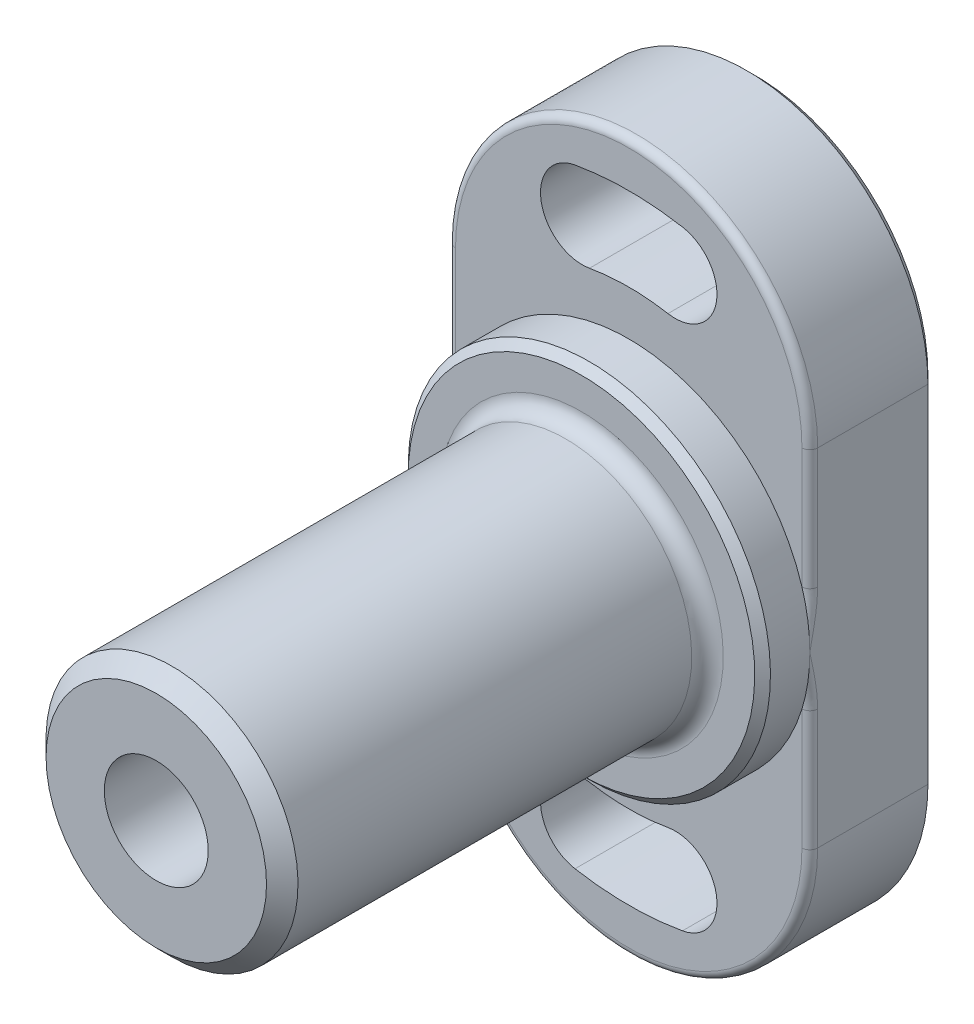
ISO-10303-21;
HEADER;
FILE_DESCRIPTION(('STEP AP214'),'2;1');
FILE_NAME('part.step','',(''),(''),'','','');
FILE_SCHEMA(('AUTOMOTIVE_DESIGN { 1 0 10303 214 1 1 1 1 }'));
ENDSEC;
DATA;
#1=APPLICATION_CONTEXT('core data for automotive mechanical design processes');
#2=APPLICATION_PROTOCOL_DEFINITION('international standard','automotive_design',2000,#1);
#3=PRODUCT_CONTEXT('',#1,'mechanical');
#4=PRODUCT('Part','Part','',(#3));
#5=PRODUCT_RELATED_PRODUCT_CATEGORY('part','',(#4));
#6=PRODUCT_DEFINITION_FORMATION('','',#4);
#7=PRODUCT_DEFINITION_CONTEXT('part definition',#1,'design');
#8=PRODUCT_DEFINITION('design','',#6,#7);
#9=PRODUCT_DEFINITION_SHAPE('','',#8);
#10=(LENGTH_UNIT() NAMED_UNIT(*) SI_UNIT(.MILLI.,.METRE.));
#11=(NAMED_UNIT(*) PLANE_ANGLE_UNIT() SI_UNIT($,.RADIAN.));
#12=(NAMED_UNIT(*) SI_UNIT($,.STERADIAN.) SOLID_ANGLE_UNIT());
#13=UNCERTAINTY_MEASURE_WITH_UNIT(LENGTH_MEASURE(1.E-05),#10,'distance_accuracy_value','');
#14=(GEOMETRIC_REPRESENTATION_CONTEXT(3) GLOBAL_UNCERTAINTY_ASSIGNED_CONTEXT((#13)) GLOBAL_UNIT_ASSIGNED_CONTEXT((#10,
#11,#12)) REPRESENTATION_CONTEXT('',''));
#15=CARTESIAN_POINT('',(0.,0.,0.));
#16=DIRECTION('',(0.,0.,1.));
#17=DIRECTION('',(1.,0.,0.));
#18=AXIS2_PLACEMENT_3D('',#15,#16,#17);
#19=CARTESIAN_POINT('',(8.,0.,38.));
#20=DIRECTION('',(0.,0.,1.));
#21=DIRECTION('',(0.,-1.,0.));
#22=AXIS2_PLACEMENT_3D('',#19,#20,#21);
#23=PLANE('',#22);
#24=CARTESIAN_POINT('',(0.,0.,38.));
#25=DIRECTION('',(0.,0.,1.));
#26=DIRECTION('',(0.,-1.,0.));
#27=AXIS2_PLACEMENT_3D('',#24,#25,#26);
#28=CIRCLE('',#27,7.);
#29=CARTESIAN_POINT('',(0.,-7.,38.));
#30=VERTEX_POINT('',#29);
#31=EDGE_CURVE('E9',#30,#30,#28,.T.);
#32=ORIENTED_EDGE('',*,*,#31,.T.);
#33=EDGE_LOOP('',(#32));
#34=FACE_BOUND('',#33,.T.);
#35=CARTESIAN_POINT('',(0.,0.,38.));
#36=DIRECTION('',(0.,0.,-1.));
#37=DIRECTION('',(0.,1.,0.));
#38=AXIS2_PLACEMENT_3D('',#35,#36,#37);
#39=CIRCLE('',#38,3.3);
#40=CARTESIAN_POINT('',(0.,3.3,38.));
#41=VERTEX_POINT('',#40);
#42=EDGE_CURVE('E210',#41,#41,#39,.T.);
#43=ORIENTED_EDGE('',*,*,#42,.T.);
#44=EDGE_LOOP('',(#43));
#45=FACE_BOUND('',#44,.T.);
#46=ADVANCED_FACE('F14',(#34,#45),#23,.T.);
#47=CARTESIAN_POINT('',(0.,0.,0.));
#48=DIRECTION('',(0.,0.,-1.));
#49=DIRECTION('',(0.,1.,0.));
#50=AXIS2_PLACEMENT_3D('',#47,#48,#49);
#51=CYLINDRICAL_SURFACE('',#50,8.);
#52=CARTESIAN_POINT('',(0.,0.,37.));
#53=DIRECTION('',(0.,0.,1.));
#54=DIRECTION('',(0.,-1.,0.));
#55=AXIS2_PLACEMENT_3D('',#52,#53,#54);
#56=CIRCLE('',#55,8.);
#57=CARTESIAN_POINT('',(0.,-8.,37.));
#58=VERTEX_POINT('',#57);
#59=EDGE_CURVE('E22',#58,#58,#56,.F.);
#60=ORIENTED_EDGE('',*,*,#59,.T.);
#61=EDGE_LOOP('',(#60));
#62=FACE_BOUND('',#61,.T.);
#63=CARTESIAN_POINT('',(0.,0.,12.));
#64=DIRECTION('',(0.,0.,1.));
#65=DIRECTION('',(0.,-1.,0.));
#66=AXIS2_PLACEMENT_3D('',#63,#64,#65);
#67=CIRCLE('',#66,8.);
#68=CARTESIAN_POINT('',(0.,-8.,12.));
#69=VERTEX_POINT('',#68);
#70=EDGE_CURVE('E569',#69,#69,#67,.T.);
#71=ORIENTED_EDGE('',*,*,#70,.T.);
#72=EDGE_LOOP('',(#71));
#73=FACE_BOUND('',#72,.T.);
#74=ADVANCED_FACE('F375',(#62,#73),#51,.T.);
#75=CARTESIAN_POINT('',(0.,0.,8.));
#76=DIRECTION('',(0.,0.,-1.));
#77=DIRECTION('',(0.,1.,0.));
#78=AXIS2_PLACEMENT_3D('',#75,#76,#77);
#79=PLANE('',#78);
#80=CARTESIAN_POINT('',(0.,0.,8.));
#81=DIRECTION('',(0.,0.,-1.));
#82=DIRECTION('',(0.,1.,0.));
#83=AXIS2_PLACEMENT_3D('',#80,#81,#82);
#84=CIRCLE('',#83,3.3);
#85=CARTESIAN_POINT('',(0.,3.3,8.));
#86=VERTEX_POINT('',#85);
#87=EDGE_CURVE('E579',#86,#86,#84,.T.);
#88=ORIENTED_EDGE('',*,*,#87,.F.);
#89=EDGE_LOOP('',(#88));
#90=FACE_BOUND('',#89,.T.);
#91=ADVANCED_FACE('F382',(#90),#79,.F.);
#92=CARTESIAN_POINT('',(0.,0.,0.));
#93=DIRECTION('',(0.,0.,-1.));
#94=DIRECTION('',(0.,1.,0.));
#95=AXIS2_PLACEMENT_3D('',#92,#93,#94);
#96=CYLINDRICAL_SURFACE('',#95,3.3);
#97=ORIENTED_EDGE('',*,*,#42,.F.);
#98=EDGE_LOOP('',(#97));
#99=FACE_BOUND('',#98,.T.);
#100=ORIENTED_EDGE('',*,*,#87,.T.);
#101=EDGE_LOOP('',(#100));
#102=FACE_BOUND('',#101,.T.);
#103=ADVANCED_FACE('F667',(#99,#102),#96,.F.);
#104=CARTESIAN_POINT('',(8.,0.,11.));
#105=DIRECTION('',(0.,0.,1.));
#106=DIRECTION('',(0.,-1.,0.));
#107=AXIS2_PLACEMENT_3D('',#104,#105,#106);
#108=PLANE('',#107);
#109=CARTESIAN_POINT('',(0.,0.,11.));
#110=DIRECTION('',(0.,0.,1.));
#111=DIRECTION('',(0.,-1.,0.));
#112=AXIS2_PLACEMENT_3D('',#109,#110,#111);
#113=CIRCLE('',#112,11.);
#114=CARTESIAN_POINT('',(0.,-11.,11.));
#115=VERTEX_POINT('',#114);
#116=EDGE_CURVE('E653',#115,#115,#113,.T.);
#117=ORIENTED_EDGE('',*,*,#116,.T.);
#118=EDGE_LOOP('',(#117));
#119=FACE_BOUND('',#118,.T.);
#120=CARTESIAN_POINT('',(0.,0.,11.));
#121=DIRECTION('',(0.,0.,1.));
#122=DIRECTION('',(0.,-1.,0.));
#123=AXIS2_PLACEMENT_3D('',#120,#121,#122);
#124=CIRCLE('',#123,9.);
#125=CARTESIAN_POINT('',(0.,-9.,11.));
#126=VERTEX_POINT('',#125);
#127=EDGE_CURVE('E566',#126,#126,#124,.F.);
#128=ORIENTED_EDGE('',*,*,#127,.T.);
#129=EDGE_LOOP('',(#128));
#130=FACE_BOUND('',#129,.T.);
#131=ADVANCED_FACE('F665',(#119,#130),#108,.T.);
#132=CARTESIAN_POINT('',(0.,0.,0.));
#133=DIRECTION('',(0.,0.,-1.));
#134=DIRECTION('',(0.,1.,0.));
#135=AXIS2_PLACEMENT_3D('',#132,#133,#134);
#136=CYLINDRICAL_SURFACE('',#135,11.5);
#137=CARTESIAN_POINT('',(0.,0.,10.5));
#138=DIRECTION('',(0.,0.,1.));
#139=DIRECTION('',(0.,-1.,0.));
#140=AXIS2_PLACEMENT_3D('',#137,#138,#139);
#141=CIRCLE('',#140,11.5);
#142=CARTESIAN_POINT('',(0.,-11.5,10.5));
#143=VERTEX_POINT('',#142);
#144=EDGE_CURVE('E650',#143,#143,#141,.F.);
#145=ORIENTED_EDGE('',*,*,#144,.T.);
#146=EDGE_LOOP('',(#145));
#147=FACE_BOUND('',#146,.T.);
#148=CARTESIAN_POINT('',(0.,0.,8.));
#149=DIRECTION('',(0.,0.,-1.));
#150=DIRECTION('',(0.,1.,0.));
#151=AXIS2_PLACEMENT_3D('',#148,#149,#150);
#152=CIRCLE('',#151,11.5);
#153=CARTESIAN_POINT('',(11.5,0.,8.));
#154=VERTEX_POINT('',#153);
#155=CARTESIAN_POINT('',(11.,-3.35410196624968,8.));
#156=VERTEX_POINT('',#155);
#157=EDGE_CURVE('E200',#154,#156,#152,.T.);
#158=ORIENTED_EDGE('',*,*,#157,.F.);
#159=CARTESIAN_POINT('',(11.,3.35410196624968,8.));
#160=VERTEX_POINT('',#159);
#161=EDGE_CURVE('E203',#160,#154,#152,.T.);
#162=ORIENTED_EDGE('',*,*,#161,.F.);
#163=CARTESIAN_POINT('',(-11.,3.35410196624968,8.));
#164=VERTEX_POINT('',#163);
#165=EDGE_CURVE('E217',#164,#160,#152,.T.);
#166=ORIENTED_EDGE('',*,*,#165,.F.);
#167=CARTESIAN_POINT('',(-11.5,0.,8.));
#168=VERTEX_POINT('',#167);
#169=EDGE_CURVE('E213',#168,#164,#152,.T.);
#170=ORIENTED_EDGE('',*,*,#169,.F.);
#171=CARTESIAN_POINT('',(-11.,-3.35410196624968,8.));
#172=VERTEX_POINT('',#171);
#173=EDGE_CURVE('E212',#172,#168,#152,.T.);
#174=ORIENTED_EDGE('',*,*,#173,.F.);
#175=EDGE_CURVE('E206',#156,#172,#152,.T.);
#176=ORIENTED_EDGE('',*,*,#175,.F.);
#177=EDGE_LOOP('',(#158,#162,#166,#170,#174,#176));
#178=FACE_BOUND('',#177,.T.);
#179=ADVANCED_FACE('F201',(#147,#178),#136,.T.);
#180=CARTESIAN_POINT('',(0.,11.,0.));
#181=DIRECTION('',(0.,0.,1.));
#182=DIRECTION('',(0.,-1.,0.));
#183=AXIS2_PLACEMENT_3D('',#180,#181,#182);
#184=PLANE('',#183);
#185=CARTESIAN_POINT('',(0.,11.,0.));
#186=DIRECTION('',(0.,0.,1.));
#187=DIRECTION('',(0.,-1.,0.));
#188=AXIS2_PLACEMENT_3D('',#185,#186,#187);
#189=CIRCLE('',#188,11.);
#190=CARTESIAN_POINT('',(-11.,11.,0.));
#191=VERTEX_POINT('',#190);
#192=CARTESIAN_POINT('',(11.,11.,0.));
#193=VERTEX_POINT('',#192);
#194=EDGE_CURVE('E975',#191,#193,#189,.F.);
#195=ORIENTED_EDGE('',*,*,#194,.T.);
#196=DIRECTION('',(0.,-1.,0.));
#197=VECTOR('',#196,1.);
#198=CARTESIAN_POINT('',(11.,11.,0.));
#199=LINE('',#198,#197);
#200=CARTESIAN_POINT('',(11.,-11.,0.));
#201=VERTEX_POINT('',#200);
#202=EDGE_CURVE('E966',#193,#201,#199,.T.);
#203=ORIENTED_EDGE('',*,*,#202,.T.);
#204=CARTESIAN_POINT('',(0.,-11.,0.));
#205=DIRECTION('',(0.,0.,1.));
#206=DIRECTION('',(0.,-1.,0.));
#207=AXIS2_PLACEMENT_3D('',#204,#205,#206);
#208=CIRCLE('',#207,11.);
#209=CARTESIAN_POINT('',(-11.,-11.,0.));
#210=VERTEX_POINT('',#209);
#211=EDGE_CURVE('E1029',#201,#210,#208,.F.);
#212=ORIENTED_EDGE('',*,*,#211,.T.);
#213=DIRECTION('',(0.,1.,0.));
#214=VECTOR('',#213,1.);
#215=CARTESIAN_POINT('',(-11.,11.,0.));
#216=LINE('',#215,#214);
#217=EDGE_CURVE('E1027',#210,#191,#216,.T.);
#218=ORIENTED_EDGE('',*,*,#217,.T.);
#219=EDGE_LOOP('',(#195,#203,#212,#218));
#220=FACE_BOUND('',#219,.T.);
#221=CARTESIAN_POINT('',(-2.95201902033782,-16.7417318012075,0.));
#222=DIRECTION('',(0.,0.,1.));
#223=DIRECTION('',(0.,-1.,0.));
#224=AXIS2_PLACEMENT_3D('',#221,#222,#223);
#225=CIRCLE('',#224,3.15);
#226=CARTESIAN_POINT('',(-2.40502726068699,-13.6395873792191,0.));
#227=VERTEX_POINT('',#226);
#228=CARTESIAN_POINT('',(-3.49901077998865,-19.843876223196,0.));
#229=VERTEX_POINT('',#228);
#230=EDGE_CURVE('E1007',#227,#229,#225,.T.);
#231=ORIENTED_EDGE('',*,*,#230,.T.);
#232=CARTESIAN_POINT('',(0.,0.,0.));
#233=DIRECTION('',(0.,0.,1.));
#234=DIRECTION('',(0.,-1.,0.));
#235=AXIS2_PLACEMENT_3D('',#232,#233,#234);
#236=CIRCLE('',#235,20.15);
#237=CARTESIAN_POINT('',(3.49901077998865,-19.843876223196,0.));
#238=VERTEX_POINT('',#237);
#239=EDGE_CURVE('E1024',#229,#238,#236,.T.);
#240=ORIENTED_EDGE('',*,*,#239,.T.);
#241=CARTESIAN_POINT('',(2.95201902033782,-16.7417318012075,0.));
#242=DIRECTION('',(0.,0.,1.));
#243=DIRECTION('',(0.,-1.,0.));
#244=AXIS2_PLACEMENT_3D('',#241,#242,#243);
#245=CIRCLE('',#244,3.15);
#246=CARTESIAN_POINT('',(2.40502726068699,-13.6395873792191,0.));
#247=VERTEX_POINT('',#246);
#248=EDGE_CURVE('E1021',#238,#247,#245,.T.);
#249=ORIENTED_EDGE('',*,*,#248,.T.);
#250=CARTESIAN_POINT('',(0.,0.,0.));
#251=DIRECTION('',(0.,0.,1.));
#252=DIRECTION('',(0.,-1.,0.));
#253=AXIS2_PLACEMENT_3D('',#250,#251,#252);
#254=CIRCLE('',#253,13.85);
#255=EDGE_CURVE('E1010',#247,#227,#254,.F.);
#256=ORIENTED_EDGE('',*,*,#255,.T.);
#257=EDGE_LOOP('',(#231,#240,#249,#256));
#258=FACE_BOUND('',#257,.T.);
#259=CARTESIAN_POINT('',(2.95201902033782,16.7417318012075,0.));
#260=DIRECTION('',(0.,0.,1.));
#261=DIRECTION('',(0.,-1.,0.));
#262=AXIS2_PLACEMENT_3D('',#259,#260,#261);
#263=CIRCLE('',#262,3.15);
#264=CARTESIAN_POINT('',(2.40502726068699,13.6395873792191,0.));
#265=VERTEX_POINT('',#264);
#266=CARTESIAN_POINT('',(3.49901077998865,19.843876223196,0.));
#267=VERTEX_POINT('',#266);
#268=EDGE_CURVE('E1042',#265,#267,#263,.T.);
#269=ORIENTED_EDGE('',*,*,#268,.T.);
#270=CARTESIAN_POINT('',(0.,0.,0.));
#271=DIRECTION('',(0.,0.,1.));
#272=DIRECTION('',(0.,-1.,0.));
#273=AXIS2_PLACEMENT_3D('',#270,#271,#272);
#274=CIRCLE('',#273,20.15);
#275=CARTESIAN_POINT('',(-3.49901077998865,19.843876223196,0.));
#276=VERTEX_POINT('',#275);
#277=EDGE_CURVE('E1039',#267,#276,#274,.T.);
#278=ORIENTED_EDGE('',*,*,#277,.T.);
#279=CARTESIAN_POINT('',(-2.95201902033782,16.7417318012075,0.));
#280=DIRECTION('',(0.,0.,1.));
#281=DIRECTION('',(0.,-1.,0.));
#282=AXIS2_PLACEMENT_3D('',#279,#280,#281);
#283=CIRCLE('',#282,3.15);
#284=CARTESIAN_POINT('',(-2.40502726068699,13.6395873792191,0.));
#285=VERTEX_POINT('',#284);
#286=EDGE_CURVE('E636',#276,#285,#283,.T.);
#287=ORIENTED_EDGE('',*,*,#286,.T.);
#288=CARTESIAN_POINT('',(0.,0.,0.));
#289=DIRECTION('',(0.,0.,1.));
#290=DIRECTION('',(0.,-1.,0.));
#291=AXIS2_PLACEMENT_3D('',#288,#289,#290);
#292=CIRCLE('',#291,13.85);
#293=EDGE_CURVE('E518',#285,#265,#292,.F.);
#294=ORIENTED_EDGE('',*,*,#293,.T.);
#295=EDGE_LOOP('',(#269,#278,#287,#294));
#296=FACE_BOUND('',#295,.T.);
#297=ADVANCED_FACE('F247',(#220,#258,#296),#184,.F.);
#298=CARTESIAN_POINT('',(0.,0.,8.));
#299=DIRECTION('',(0.,0.,-1.));
#300=DIRECTION('',(0.,1.,0.));
#301=AXIS2_PLACEMENT_3D('',#298,#299,#300);
#302=CYLINDRICAL_SURFACE('',#301,14.35);
#303=DIRECTION('',(0.,0.,-1.));
#304=VECTOR('',#303,1.);
#305=CARTESIAN_POINT('',(2.49185134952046,14.1319912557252,8.));
#306=LINE('',#305,#304);
#307=CARTESIAN_POINT('',(2.49185134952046,14.1319912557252,8.));
#308=VERTEX_POINT('',#307);
#309=CARTESIAN_POINT('',(2.49185134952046,14.1319912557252,0.500000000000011));
#310=VERTEX_POINT('',#309);
#311=EDGE_CURVE('E614',#308,#310,#306,.T.);
#312=ORIENTED_EDGE('',*,*,#311,.T.);
#313=CARTESIAN_POINT('',(0.,0.,0.500000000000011));
#314=DIRECTION('',(0.,0.,1.));
#315=DIRECTION('',(0.,-1.,0.));
#316=AXIS2_PLACEMENT_3D('',#313,#314,#315);
#317=CIRCLE('',#316,14.35);
#318=CARTESIAN_POINT('',(-2.49185134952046,14.1319912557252,0.500000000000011));
#319=VERTEX_POINT('',#318);
#320=EDGE_CURVE('E36',#310,#319,#317,.T.);
#321=ORIENTED_EDGE('',*,*,#320,.T.);
#322=DIRECTION('',(0.,0.,-1.));
#323=VECTOR('',#322,1.);
#324=CARTESIAN_POINT('',(-2.49185134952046,14.1319912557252,8.));
#325=LINE('',#324,#323);
#326=CARTESIAN_POINT('',(-2.49185134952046,14.1319912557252,8.));
#327=VERTEX_POINT('',#326);
#328=EDGE_CURVE('E616',#327,#319,#325,.T.);
#329=ORIENTED_EDGE('',*,*,#328,.F.);
#330=CARTESIAN_POINT('',(0.,0.,8.));
#331=DIRECTION('',(0.,0.,-1.));
#332=DIRECTION('',(0.,-1.,0.));
#333=AXIS2_PLACEMENT_3D('',#330,#331,#332);
#334=CIRCLE('',#333,14.35);
#335=EDGE_CURVE('E607',#327,#308,#334,.T.);
#336=ORIENTED_EDGE('',*,*,#335,.T.);
#337=EDGE_LOOP('',(#312,#321,#329,#336));
#338=FACE_BOUND('',#337,.T.);
#339=ADVANCED_FACE('F408',(#338),#302,.T.);
#340=CARTESIAN_POINT('',(2.95201902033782,16.7417318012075,8.));
#341=DIRECTION('',(0.,0.,-1.));
#342=DIRECTION('',(0.,1.,0.));
#343=AXIS2_PLACEMENT_3D('',#340,#341,#342);
#344=CYLINDRICAL_SURFACE('',#343,2.65);
#345=DIRECTION('',(0.,0.,-1.));
#346=VECTOR('',#345,1.);
#347=CARTESIAN_POINT('',(3.41218669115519,19.3514723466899,8.));
#348=LINE('',#347,#346);
#349=CARTESIAN_POINT('',(3.41218669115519,19.3514723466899,8.));
#350=VERTEX_POINT('',#349);
#351=CARTESIAN_POINT('',(3.41218669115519,19.3514723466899,0.500000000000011));
#352=VERTEX_POINT('',#351);
#353=EDGE_CURVE('E612',#350,#352,#348,.T.);
#354=ORIENTED_EDGE('',*,*,#353,.T.);
#355=CARTESIAN_POINT('',(2.95201902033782,16.7417318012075,0.500000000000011));
#356=DIRECTION('',(0.,0.,1.));
#357=DIRECTION('',(0.,-1.,0.));
#358=AXIS2_PLACEMENT_3D('',#355,#356,#357);
#359=CIRCLE('',#358,2.65);
#360=EDGE_CURVE('E29',#352,#310,#359,.F.);
#361=ORIENTED_EDGE('',*,*,#360,.T.);
#362=ORIENTED_EDGE('',*,*,#311,.F.);
#363=CARTESIAN_POINT('',(2.95201902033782,16.7417318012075,8.));
#364=DIRECTION('',(0.,0.,1.));
#365=DIRECTION('',(0.,-1.,0.));
#366=AXIS2_PLACEMENT_3D('',#363,#364,#365);
#367=CIRCLE('',#366,2.65);
#368=EDGE_CURVE('E610',#308,#350,#367,.T.);
#369=ORIENTED_EDGE('',*,*,#368,.T.);
#370=EDGE_LOOP('',(#354,#361,#362,#369));
#371=FACE_BOUND('',#370,.T.);
#372=ADVANCED_FACE('F404',(#371),#344,.F.);
#373=CARTESIAN_POINT('',(0.,0.,8.));
#374=DIRECTION('',(0.,0.,-1.));
#375=DIRECTION('',(0.,1.,0.));
#376=AXIS2_PLACEMENT_3D('',#373,#374,#375);
#377=CYLINDRICAL_SURFACE('',#376,19.65);
#378=DIRECTION('',(0.,0.,-1.));
#379=VECTOR('',#378,1.);
#380=CARTESIAN_POINT('',(-3.41218669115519,19.3514723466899,8.));
#381=LINE('',#380,#379);
#382=CARTESIAN_POINT('',(-3.41218669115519,19.3514723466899,8.));
#383=VERTEX_POINT('',#382);
#384=CARTESIAN_POINT('',(-3.41218669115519,19.3514723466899,0.500000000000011));
#385=VERTEX_POINT('',#384);
#386=EDGE_CURVE('E560',#383,#385,#381,.T.);
#387=ORIENTED_EDGE('',*,*,#386,.T.);
#388=CARTESIAN_POINT('',(0.,0.,0.500000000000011));
#389=DIRECTION('',(0.,0.,1.));
#390=DIRECTION('',(0.,-1.,0.));
#391=AXIS2_PLACEMENT_3D('',#388,#389,#390);
#392=CIRCLE('',#391,19.65);
#393=EDGE_CURVE('E622',#385,#352,#392,.F.);
#394=ORIENTED_EDGE('',*,*,#393,.T.);
#395=ORIENTED_EDGE('',*,*,#353,.F.);
#396=CARTESIAN_POINT('',(0.,0.,8.));
#397=DIRECTION('',(0.,0.,1.));
#398=DIRECTION('',(0.,-1.,0.));
#399=AXIS2_PLACEMENT_3D('',#396,#397,#398);
#400=CIRCLE('',#399,19.65);
#401=EDGE_CURVE('E603',#350,#383,#400,.T.);
#402=ORIENTED_EDGE('',*,*,#401,.T.);
#403=EDGE_LOOP('',(#387,#394,#395,#402));
#404=FACE_BOUND('',#403,.T.);
#405=ADVANCED_FACE('F407',(#404),#377,.F.);
#406=CARTESIAN_POINT('',(-2.95201902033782,16.7417318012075,8.));
#407=DIRECTION('',(0.,0.,-1.));
#408=DIRECTION('',(0.,1.,0.));
#409=AXIS2_PLACEMENT_3D('',#406,#407,#408);
#410=CYLINDRICAL_SURFACE('',#409,2.65);
#411=ORIENTED_EDGE('',*,*,#328,.T.);
#412=CARTESIAN_POINT('',(-2.95201902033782,16.7417318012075,0.500000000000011));
#413=DIRECTION('',(0.,0.,1.));
#414=DIRECTION('',(0.,-1.,0.));
#415=AXIS2_PLACEMENT_3D('',#412,#413,#414);
#416=CIRCLE('',#415,2.65);
#417=EDGE_CURVE('E631',#319,#385,#416,.F.);
#418=ORIENTED_EDGE('',*,*,#417,.T.);
#419=ORIENTED_EDGE('',*,*,#386,.F.);
#420=CARTESIAN_POINT('',(-2.95201902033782,16.7417318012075,8.));
#421=DIRECTION('',(0.,0.,1.));
#422=DIRECTION('',(0.,1.,0.));
#423=AXIS2_PLACEMENT_3D('',#420,#421,#422);
#424=CIRCLE('',#423,2.65);
#425=EDGE_CURVE('E605',#383,#327,#424,.T.);
#426=ORIENTED_EDGE('',*,*,#425,.T.);
#427=EDGE_LOOP('',(#411,#418,#419,#426));
#428=FACE_BOUND('',#427,.T.);
#429=ADVANCED_FACE('F411',(#428),#410,.F.);
#430=CARTESIAN_POINT('',(0.,11.,8.));
#431=DIRECTION('',(0.,0.,-1.));
#432=DIRECTION('',(0.,1.,0.));
#433=AXIS2_PLACEMENT_3D('',#430,#431,#432);
#434=CYLINDRICAL_SURFACE('',#433,11.5);
#435=DIRECTION('',(0.,0.,-1.));
#436=VECTOR('',#435,1.);
#437=CARTESIAN_POINT('',(11.5,11.,8.));
#438=LINE('',#437,#436);
#439=CARTESIAN_POINT('',(11.5,11.,7.5));
#440=VERTEX_POINT('',#439);
#441=CARTESIAN_POINT('',(11.5,11.,0.499999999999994));
#442=VERTEX_POINT('',#441);
#443=EDGE_CURVE('E556',#440,#442,#438,.T.);
#444=ORIENTED_EDGE('',*,*,#443,.T.);
#445=CARTESIAN_POINT('',(0.,11.,0.499999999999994));
#446=DIRECTION('',(0.,0.,1.));
#447=DIRECTION('',(0.,-1.,0.));
#448=AXIS2_PLACEMENT_3D('',#445,#446,#447);
#449=CIRCLE('',#448,11.5);
#450=CARTESIAN_POINT('',(-11.5,11.,0.499999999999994));
#451=VERTEX_POINT('',#450);
#452=EDGE_CURVE('E958',#442,#451,#449,.T.);
#453=ORIENTED_EDGE('',*,*,#452,.T.);
#454=DIRECTION('',(0.,0.,-1.));
#455=VECTOR('',#454,1.);
#456=CARTESIAN_POINT('',(-11.5,11.,8.));
#457=LINE('',#456,#455);
#458=CARTESIAN_POINT('',(-11.5,11.,7.5));
#459=VERTEX_POINT('',#458);
#460=EDGE_CURVE('E558',#459,#451,#457,.T.);
#461=ORIENTED_EDGE('',*,*,#460,.F.);
#462=CARTESIAN_POINT('',(0.,11.,7.5));
#463=DIRECTION('',(0.,0.,1.));
#464=DIRECTION('',(0.,-1.,0.));
#465=AXIS2_PLACEMENT_3D('',#462,#463,#464);
#466=CIRCLE('',#465,11.5);
#467=EDGE_CURVE('E472',#459,#440,#466,.F.);
#468=ORIENTED_EDGE('',*,*,#467,.T.);
#469=EDGE_LOOP('',(#444,#453,#461,#468));
#470=FACE_BOUND('',#469,.T.);
#471=ADVANCED_FACE('F396',(#470),#434,.T.);
#472=CARTESIAN_POINT('',(-2.95201902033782,-16.7417318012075,8.));
#473=DIRECTION('',(0.,0.,-1.));
#474=DIRECTION('',(0.,1.,0.));
#475=AXIS2_PLACEMENT_3D('',#472,#473,#474);
#476=CYLINDRICAL_SURFACE('',#475,2.65);
#477=DIRECTION('',(0.,0.,-1.));
#478=VECTOR('',#477,1.);
#479=CARTESIAN_POINT('',(-3.41218669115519,-19.3514723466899,8.));
#480=LINE('',#479,#478);
#481=CARTESIAN_POINT('',(-3.41218669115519,-19.3514723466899,8.));
#482=VERTEX_POINT('',#481);
#483=CARTESIAN_POINT('',(-3.41218669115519,-19.3514723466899,0.500000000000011));
#484=VERTEX_POINT('',#483);
#485=EDGE_CURVE('E594',#482,#484,#480,.T.);
#486=ORIENTED_EDGE('',*,*,#485,.T.);
#487=CARTESIAN_POINT('',(-2.95201902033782,-16.7417318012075,0.500000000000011));
#488=DIRECTION('',(0.,0.,1.));
#489=DIRECTION('',(0.,-1.,0.));
#490=AXIS2_PLACEMENT_3D('',#487,#488,#489);
#491=CIRCLE('',#490,2.65);
#492=CARTESIAN_POINT('',(-2.49185134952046,-14.1319912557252,0.500000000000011));
#493=VERTEX_POINT('',#492);
#494=EDGE_CURVE('E985',#484,#493,#491,.F.);
#495=ORIENTED_EDGE('',*,*,#494,.T.);
#496=DIRECTION('',(0.,0.,-1.));
#497=VECTOR('',#496,1.);
#498=CARTESIAN_POINT('',(-2.49185134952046,-14.1319912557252,8.));
#499=LINE('',#498,#497);
#500=CARTESIAN_POINT('',(-2.49185134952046,-14.1319912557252,8.));
#501=VERTEX_POINT('',#500);
#502=EDGE_CURVE('E597',#501,#493,#499,.T.);
#503=ORIENTED_EDGE('',*,*,#502,.F.);
#504=CARTESIAN_POINT('',(-2.95201902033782,-16.7417318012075,8.));
#505=DIRECTION('',(0.,0.,1.));
#506=DIRECTION('',(0.,-1.,0.));
#507=AXIS2_PLACEMENT_3D('',#504,#505,#506);
#508=CIRCLE('',#507,2.65);
#509=EDGE_CURVE('E586',#501,#482,#508,.T.);
#510=ORIENTED_EDGE('',*,*,#509,.T.);
#511=EDGE_LOOP('',(#486,#495,#503,#510));
#512=FACE_BOUND('',#511,.T.);
#513=ADVANCED_FACE('F392',(#512),#476,.F.);
#514=CARTESIAN_POINT('',(0.,0.,8.));
#515=DIRECTION('',(0.,0.,-1.));
#516=DIRECTION('',(0.,1.,0.));
#517=AXIS2_PLACEMENT_3D('',#514,#515,#516);
#518=CYLINDRICAL_SURFACE('',#517,19.65);
#519=DIRECTION('',(0.,0.,-1.));
#520=VECTOR('',#519,1.);
#521=CARTESIAN_POINT('',(3.41218669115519,-19.3514723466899,8.));
#522=LINE('',#521,#520);
#523=CARTESIAN_POINT('',(3.41218669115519,-19.3514723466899,8.));
#524=VERTEX_POINT('',#523);
#525=CARTESIAN_POINT('',(3.41218669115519,-19.3514723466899,0.500000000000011));
#526=VERTEX_POINT('',#525);
#527=EDGE_CURVE('E591',#524,#526,#522,.T.);
#528=ORIENTED_EDGE('',*,*,#527,.T.);
#529=CARTESIAN_POINT('',(0.,0.,0.500000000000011));
#530=DIRECTION('',(0.,0.,1.));
#531=DIRECTION('',(0.,-1.,0.));
#532=AXIS2_PLACEMENT_3D('',#529,#530,#531);
#533=CIRCLE('',#532,19.65);
#534=EDGE_CURVE('E980',#526,#484,#533,.F.);
#535=ORIENTED_EDGE('',*,*,#534,.T.);
#536=ORIENTED_EDGE('',*,*,#485,.F.);
#537=CARTESIAN_POINT('',(0.,0.,8.));
#538=DIRECTION('',(0.,0.,1.));
#539=DIRECTION('',(0.,1.,0.));
#540=AXIS2_PLACEMENT_3D('',#537,#538,#539);
#541=CIRCLE('',#540,19.65);
#542=EDGE_CURVE('E589',#482,#524,#541,.T.);
#543=ORIENTED_EDGE('',*,*,#542,.T.);
#544=EDGE_LOOP('',(#528,#535,#536,#543));
#545=FACE_BOUND('',#544,.T.);
#546=ADVANCED_FACE('F388',(#545),#518,.F.);
#547=CARTESIAN_POINT('',(2.95201902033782,-16.7417318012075,8.));
#548=DIRECTION('',(0.,0.,-1.));
#549=DIRECTION('',(0.,1.,0.));
#550=AXIS2_PLACEMENT_3D('',#547,#548,#549);
#551=CYLINDRICAL_SURFACE('',#550,2.65);
#552=DIRECTION('',(0.,0.,-1.));
#553=VECTOR('',#552,1.);
#554=CARTESIAN_POINT('',(2.49185134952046,-14.1319912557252,8.));
#555=LINE('',#554,#553);
#556=CARTESIAN_POINT('',(2.49185134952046,-14.1319912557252,8.));
#557=VERTEX_POINT('',#556);
#558=CARTESIAN_POINT('',(2.49185134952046,-14.1319912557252,0.500000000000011));
#559=VERTEX_POINT('',#558);
#560=EDGE_CURVE('E600',#557,#559,#555,.T.);
#561=ORIENTED_EDGE('',*,*,#560,.T.);
#562=CARTESIAN_POINT('',(2.95201902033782,-16.7417318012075,0.500000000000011));
#563=DIRECTION('',(0.,0.,1.));
#564=DIRECTION('',(0.,-1.,0.));
#565=AXIS2_PLACEMENT_3D('',#562,#563,#564);
#566=CIRCLE('',#565,2.65);
#567=EDGE_CURVE('E983',#559,#526,#566,.F.);
#568=ORIENTED_EDGE('',*,*,#567,.T.);
#569=ORIENTED_EDGE('',*,*,#527,.F.);
#570=CARTESIAN_POINT('',(2.95201902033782,-16.7417318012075,8.));
#571=DIRECTION('',(0.,0.,1.));
#572=DIRECTION('',(0.,1.,0.));
#573=AXIS2_PLACEMENT_3D('',#570,#571,#572);
#574=CIRCLE('',#573,2.65);
#575=EDGE_CURVE('E582',#524,#557,#574,.T.);
#576=ORIENTED_EDGE('',*,*,#575,.T.);
#577=EDGE_LOOP('',(#561,#568,#569,#576));
#578=FACE_BOUND('',#577,.T.);
#579=ADVANCED_FACE('F391',(#578),#551,.F.);
#580=CARTESIAN_POINT('',(0.,0.,8.));
#581=DIRECTION('',(0.,0.,-1.));
#582=DIRECTION('',(0.,1.,0.));
#583=AXIS2_PLACEMENT_3D('',#580,#581,#582);
#584=CYLINDRICAL_SURFACE('',#583,14.35);
#585=ORIENTED_EDGE('',*,*,#502,.T.);
#586=CARTESIAN_POINT('',(0.,0.,0.500000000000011));
#587=DIRECTION('',(0.,0.,1.));
#588=DIRECTION('',(0.,-1.,0.));
#589=AXIS2_PLACEMENT_3D('',#586,#587,#588);
#590=CIRCLE('',#589,14.35);
#591=EDGE_CURVE('E632',#493,#559,#590,.T.);
#592=ORIENTED_EDGE('',*,*,#591,.T.);
#593=ORIENTED_EDGE('',*,*,#560,.F.);
#594=CARTESIAN_POINT('',(0.,0.,8.));
#595=DIRECTION('',(0.,0.,-1.));
#596=DIRECTION('',(0.,1.,0.));
#597=AXIS2_PLACEMENT_3D('',#594,#595,#596);
#598=CIRCLE('',#597,14.35);
#599=EDGE_CURVE('E584',#557,#501,#598,.T.);
#600=ORIENTED_EDGE('',*,*,#599,.T.);
#601=EDGE_LOOP('',(#585,#592,#593,#600));
#602=FACE_BOUND('',#601,.T.);
#603=ADVANCED_FACE('F246',(#602),#584,.T.);
#604=CARTESIAN_POINT('',(11.5,11.,8.));
#605=DIRECTION('',(-1.,0.,0.));
#606=DIRECTION('',(0.,-1.,0.));
#607=AXIS2_PLACEMENT_3D('',#604,#605,#606);
#608=PLANE('',#607);
#609=DIRECTION('',(0.,0.,-1.));
#610=VECTOR('',#609,1.);
#611=CARTESIAN_POINT('',(11.5,-11.,8.));
#612=LINE('',#611,#610);
#613=CARTESIAN_POINT('',(11.5,-11.,7.5));
#614=VERTEX_POINT('',#613);
#615=CARTESIAN_POINT('',(11.5,-11.,0.499999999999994));
#616=VERTEX_POINT('',#615);
#617=EDGE_CURVE('E549',#614,#616,#612,.T.);
#618=ORIENTED_EDGE('',*,*,#617,.T.);
#619=DIRECTION('',(0.,1.,0.));
#620=VECTOR('',#619,1.);
#621=CARTESIAN_POINT('',(11.5,11.,0.499999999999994));
#622=LINE('',#621,#620);
#623=EDGE_CURVE('E311',#616,#442,#622,.T.);
#624=ORIENTED_EDGE('',*,*,#623,.T.);
#625=ORIENTED_EDGE('',*,*,#443,.F.);
#626=DIRECTION('',(0.,1.,0.));
#627=VECTOR('',#626,1.);
#628=CARTESIAN_POINT('',(11.5,0.,7.5));
#629=LINE('',#628,#627);
#630=CARTESIAN_POINT('',(11.5,3.35410196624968,7.5));
#631=VERTEX_POINT('',#630);
#632=EDGE_CURVE('E191',#440,#631,#629,.F.);
#633=ORIENTED_EDGE('',*,*,#632,.T.);
#634=CARTESIAN_POINT('',(10.6934689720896,4.23080622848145,8.));
#635=CARTESIAN_POINT('',(10.9398510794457,4.17210729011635,8.18195721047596));
#636=CARTESIAN_POINT('',(11.2199255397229,4.21422177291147,8.05140912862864));
#637=CARTESIAN_POINT('',(11.5,4.25633625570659,7.92086104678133));
#638=CARTESIAN_POINT('',(11.5,4.35208339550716,7.62406040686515));
#639=CARTESIAN_POINT('',(10.7060848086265,4.19892264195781,8.));
#640=CARTESIAN_POINT('',(10.9541113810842,4.14812409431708,8.17264684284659));
#641=CARTESIAN_POINT('',(11.2270885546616,4.18759299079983,8.03911982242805));
#642=CARTESIAN_POINT('',(11.5,4.22733967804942,7.90570923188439));
#643=CARTESIAN_POINT('',(11.5,4.31415013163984,7.61185894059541));
#644=CARTESIAN_POINT('',(10.71873128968,4.16653842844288,8.));
#645=CARTESIAN_POINT('',(10.9678107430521,4.12218684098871,8.1633347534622));
#646=CARTESIAN_POINT('',(11.2339339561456,4.15926974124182,8.02735474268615));
#647=CARTESIAN_POINT('',(11.5,4.19662012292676,7.89147327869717));
#648=CARTESIAN_POINT('',(11.5,4.27582612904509,7.60096852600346));
#649=CARTESIAN_POINT('',(10.7439858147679,4.10097477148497,8.));
#650=CARTESIAN_POINT('',(10.9940677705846,4.06751935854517,8.1450823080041));
#651=CARTESIAN_POINT('',(11.2470634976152,4.10006704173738,8.00494636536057));
#652=CARTESIAN_POINT('',(11.5,4.13287217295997,7.86491053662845));
#653=CARTESIAN_POINT('',(11.5,4.19865030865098,7.58141708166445));
#654=CARTESIAN_POINT('',(10.7565938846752,4.06779616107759,8.));
#655=CARTESIAN_POINT('',(11.0066476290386,4.03879347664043,8.13613065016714));
#656=CARTESIAN_POINT('',(11.2533481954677,4.06919019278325,7.99430195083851));
#657=CARTESIAN_POINT('',(11.5,4.09983957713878,7.85255392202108));
#658=CARTESIAN_POINT('',(11.5,4.159799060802,7.57275381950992));
#659=CARTESIAN_POINT('',(10.7816555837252,4.00089703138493,8.));
#660=CARTESIAN_POINT('',(11.0308010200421,3.97944731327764,8.11886555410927));
#661=CARTESIAN_POINT('',(11.2654241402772,4.00576254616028,7.97421692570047));
#662=CARTESIAN_POINT('',(11.5,4.03232941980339,7.8296473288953));
#663=CARTESIAN_POINT('',(11.5,4.08187584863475,7.55726699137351));
#664=CARTESIAN_POINT('',(10.7941095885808,3.96717869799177,8.));
#665=CARTESIAN_POINT('',(11.0423935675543,3.9488291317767,8.11053943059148));
#666=CARTESIAN_POINT('',(11.271216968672,3.97321769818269,7.9647724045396));
#667=CARTESIAN_POINT('',(11.5,3.99784630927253,7.81906978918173));
#668=CARTESIAN_POINT('',(11.5,4.0428050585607,7.5504373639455));
#669=CARTESIAN_POINT('',(10.8188597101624,3.8991773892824,8.));
#670=CARTESIAN_POINT('',(11.0647471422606,3.88605899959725,8.09454139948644));
#671=CARTESIAN_POINT('',(11.2823935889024,3.90677952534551,7.94698459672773));
#672=CARTESIAN_POINT('',(11.5,3.92773796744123,7.79949135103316));
#673=CARTESIAN_POINT('',(11.5,3.96441650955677,7.53831944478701));
#674=CARTESIAN_POINT('',(10.8311557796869,3.86489425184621,8.));
#675=CARTESIAN_POINT('',(11.0755206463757,3.85389853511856,8.08686015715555));
#676=CARTESIAN_POINT('',(11.287777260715,3.87288580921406,7.93864163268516));
#677=CARTESIAN_POINT('',(11.5,3.8920993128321,7.79047370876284));
#678=CARTESIAN_POINT('',(11.5,3.92509868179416,7.53303160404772));
#679=CARTESIAN_POINT('',(10.8674768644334,3.7620723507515,8.));
#680=CARTESIAN_POINT('',(11.1064164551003,3.75667581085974,8.06506185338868));
#681=CARTESIAN_POINT('',(11.3032749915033,3.77044000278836,7.91533633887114));
#682=CARTESIAN_POINT('',(11.5,3.78508235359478,7.76581228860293));
#683=CARTESIAN_POINT('',(11.5,3.80777602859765,7.51926096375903));
#684=CARTESIAN_POINT('',(10.8912115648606,3.69282346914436,8.));
#685=CARTESIAN_POINT('',(11.1256310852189,3.68952651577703,8.05181249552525));
#686=CARTESIAN_POINT('',(11.3128658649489,3.70041141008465,7.90188036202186));
#687=CARTESIAN_POINT('',(11.5,3.71208328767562,7.75207979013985));
#688=CARTESIAN_POINT('',(11.5,3.72954290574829,7.51271136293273));
#689=CARTESIAN_POINT('',(10.9377148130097,3.55272504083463,8.));
#690=CARTESIAN_POINT('',(11.1617468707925,3.55218656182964,8.0278237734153));
#691=CARTESIAN_POINT('',(11.3309222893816,3.55781951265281,7.87843092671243));
#692=CARTESIAN_POINT('',(11.5,3.56423179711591,7.72916412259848));
#693=CARTESIAN_POINT('',(11.5,3.57278907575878,7.50366805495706));
#694=CARTESIAN_POINT('',(10.9604823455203,3.48187392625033,8.));
#695=CARTESIAN_POINT('',(11.1786991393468,3.48191832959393,8.01704085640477));
#696=CARTESIAN_POINT('',(11.3393866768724,3.48525368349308,7.86844103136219));
#697=CARTESIAN_POINT('',(11.5,3.48928184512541,7.71991812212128));
#698=CARTESIAN_POINT('',(11.5,3.49426815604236,7.50117851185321));
#699=CARTESIAN_POINT('',(11.0229541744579,3.28068536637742,8.));
#700=CARTESIAN_POINT('',(11.2234935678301,3.28209134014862,7.98999917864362));
#701=CARTESIAN_POINT('',(11.361871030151,3.27879630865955,7.84449648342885));
#702=CARTESIAN_POINT('',(11.5,3.27776269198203,7.69926220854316));
#703=CARTESIAN_POINT('',(11.5,3.27333429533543,7.49878774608));
#704=CARTESIAN_POINT('',(11.0613778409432,3.14882032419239,8.));
#705=CARTESIAN_POINT('',(11.2494655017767,3.14907372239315,7.97607950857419));
#706=CARTESIAN_POINT('',(11.3748123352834,3.14301519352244,7.8339224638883));
#707=CARTESIAN_POINT('',(11.5,3.13878885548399,7.69186348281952));
#708=CARTESIAN_POINT('',(11.5,3.13088207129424,7.50263686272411));
#709=CARTESIAN_POINT('',(11.1340035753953,2.88152326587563,8.));
#710=CARTESIAN_POINT('',(11.2964327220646,2.87927306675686,7.95427507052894));
#711=CARTESIAN_POINT('',(11.3982922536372,2.86857613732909,7.82013663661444));
#712=CARTESIAN_POINT('',(11.5,2.85968116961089,7.68608276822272));
#713=CARTESIAN_POINT('',(11.5,2.84637763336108,7.51807349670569));
#714=CARTESIAN_POINT('',(11.1682030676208,2.74608913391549,8.));
#715=CARTESIAN_POINT('',(11.3175595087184,2.7421386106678,7.94628274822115));
#716=CARTESIAN_POINT('',(11.4088294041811,2.72991650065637,7.81692930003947));
#717=CARTESIAN_POINT('',(11.5,2.71914962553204,7.68757965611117));
#718=CARTESIAN_POINT('',(11.5,2.70432571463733,7.52966570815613));
#719=CARTESIAN_POINT('',(11.2320242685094,2.47213041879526,8.));
#720=CARTESIAN_POINT('',(11.3556984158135,2.46537747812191,7.93506721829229));
#721=CARTESIAN_POINT('',(11.4278985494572,2.45078229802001,7.81618720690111));
#722=CARTESIAN_POINT('',(11.5,2.43762997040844,7.6973110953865));
#723=CARTESIAN_POINT('',(11.5,2.42065933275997,7.55867349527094));
#724=CARTESIAN_POINT('',(11.2616403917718,2.33360229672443,8.));
#725=CARTESIAN_POINT('',(11.3727929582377,2.32544694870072,7.93178740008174));
#726=CARTESIAN_POINT('',(11.4364281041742,2.31030574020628,7.81865931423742));
#727=CARTESIAN_POINT('',(11.5,2.2963138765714,7.70549584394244));
#728=CARTESIAN_POINT('',(11.5,2.2790456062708,7.57609609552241));
#729=CARTESIAN_POINT('',(11.3159578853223,2.05411419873,8.));
#730=CARTESIAN_POINT('',(11.403370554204,2.04407711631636,7.92897452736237));
#731=CARTESIAN_POINT('',(11.4517155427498,2.02835432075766,7.82797438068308));
#732=CARTESIAN_POINT('',(11.5,2.01376498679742,7.72693421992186));
#733=CARTESIAN_POINT('',(11.5,1.99642079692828,7.61533717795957));
#734=CARTESIAN_POINT('',(11.3406584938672,1.91315384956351,8.));
#735=CARTESIAN_POINT('',(11.4169120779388,1.90237363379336,7.92940917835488));
#736=CARTESIAN_POINT('',(11.4584731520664,1.88687930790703,7.83481801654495));
#737=CARTESIAN_POINT('',(11.5,1.87225430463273,7.74016892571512));
#738=CARTESIAN_POINT('',(11.5,1.85540981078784,7.63715634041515));
#739=CARTESIAN_POINT('',(11.4074260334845,1.48477532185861,8.));
#740=CARTESIAN_POINT('',(11.4527486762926,1.4746382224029,7.935010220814));
#741=CARTESIAN_POINT('',(11.4764514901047,1.45899919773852,7.86040907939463));
#742=CARTESIAN_POINT('',(11.5,1.44692309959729,7.78560671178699));
#743=CARTESIAN_POINT('',(11.5,1.43063540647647,7.70791256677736));
#744=CARTESIAN_POINT('',(11.4415663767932,1.19437641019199,8.));
#745=CARTESIAN_POINT('',(11.4703823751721,1.18440182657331,7.94449926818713));
#746=CARTESIAN_POINT('',(11.4852104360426,1.1717025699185,7.88418186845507));
#747=CARTESIAN_POINT('',(11.5,1.16073486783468,7.82371749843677));
#748=CARTESIAN_POINT('',(11.5,1.14771671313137,7.76183990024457));
#749=CARTESIAN_POINT('',(11.4875611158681,0.609816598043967,8.));
#750=CARTESIAN_POINT('',(11.4937926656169,0.604056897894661,7.96892996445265));
#751=CARTESIAN_POINT('',(11.4969116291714,0.596601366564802,7.93788717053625));
#752=CARTESIAN_POINT('',(11.5,0.590808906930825,7.90667443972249));
#753=CARTESIAN_POINT('',(11.5,0.583367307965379,7.87570019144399));
#754=CARTESIAN_POINT('',(11.49943104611,0.315658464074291,8.));
#755=CARTESIAN_POINT('',(11.4997156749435,0.312247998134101,7.98390735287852));
#756=CARTESIAN_POINT('',(11.4998579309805,0.308797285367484,7.96781537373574));
#757=CARTESIAN_POINT('',(11.5,0.305386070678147,7.95171930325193));
#758=CARTESIAN_POINT('',(11.5,0.301935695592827,7.93562893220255));
#759=CARTESIAN_POINT('',(11.4999866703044,0.0178726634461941,8.));
#760=CARTESIAN_POINT('',(11.4999933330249,0.0176784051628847,7.99908882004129));
#761=CARTESIAN_POINT('',(11.4999966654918,0.0174841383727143,7.99817762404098));
#762=CARTESIAN_POINT('',(11.5,0.0172898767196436,7.99726642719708));
#763=CARTESIAN_POINT('',(11.5,0.0170956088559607,7.99635522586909));
#764=CARTESIAN_POINT('',(11.4999916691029,0.0142977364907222,8.));
#765=CARTESIAN_POINT('',(11.4999958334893,0.014142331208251,7.99927107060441));
#766=CARTESIAN_POINT('',(11.4999979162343,0.0139869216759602,7.9985421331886));
#767=CARTESIAN_POINT('',(11.5,0.0138315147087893,7.99781319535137));
#768=CARTESIAN_POINT('',(11.5,0.0136761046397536,7.99708425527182));
#769=CARTESIAN_POINT('',(11.4999983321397,0.00714853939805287,8.));
#770=CARTESIAN_POINT('',(11.4999991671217,0.00707083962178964,7.99963554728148));
#771=CARTESIAN_POINT('',(11.4999995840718,0.00699313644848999,7.99927109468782));
#772=CARTESIAN_POINT('',(11.5,0.00691543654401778,7.99890664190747));
#773=CARTESIAN_POINT('',(11.5,0.0068377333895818,7.99854218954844));
#774=CARTESIAN_POINT('',(11.4999999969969,0.00357426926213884,8.));
#775=CARTESIAN_POINT('',(11.5000000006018,0.00353541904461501,7.9998177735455));
#776=CARTESIAN_POINT('',(11.5000000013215,0.00349656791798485,7.99963554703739));
#777=CARTESIAN_POINT('',(11.5,0.00345771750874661,7.99945332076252));
#778=CARTESIAN_POINT('',(11.5,0.00341886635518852,7.99927109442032));
#779=CARTESIAN_POINT('',(11.5,0.,8.));
#780=CARTESIAN_POINT('',(11.5,0.,8.));
#781=CARTESIAN_POINT('',(11.5,0.,8.));
#782=CARTESIAN_POINT('',(11.5,0.,8.));
#783=CARTESIAN_POINT('',(11.5,0.,8.));
#784=(BOUNDED_SURFACE() B_SPLINE_SURFACE(3,2,((#634,#635,#636,#637,#638),(#639,#640,#641,#642,
#643),(#644,#645,#646,#647,#648),(#649,#650,#651,#652,#653),(#654,#655,#656,#657,#658),(#659,
#660,#661,#662,#663),(#664,#665,#666,#667,#668),(#669,#670,#671,#672,#673),(#674,#675,#676,#677,
#678),(#679,#680,#681,#682,#683),(#684,#685,#686,#687,#688),(#689,#690,#691,#692,#693),(#694,
#695,#696,#697,#698),(#699,#700,#701,#702,#703),(#704,#705,#706,#707,#708),(#709,#710,#711,#712,
#713),(#714,#715,#716,#717,#718),(#719,#720,#721,#722,#723),(#724,#725,#726,#727,#728),(#729,
#730,#731,#732,#733),(#734,#735,#736,#737,#738),(#739,#740,#741,#742,#743),(#744,#745,#746,#747,
#748),(#749,#750,#751,#752,#753),(#754,#755,#756,#757,#758),(#759,#760,#761,#762,#763),(#764,
#765,#766,#767,#768),(#769,#770,#771,#772,#773),(#774,#775,#776,#777,#778),(#779,#780,#781,#782,
#783)),.UNSPECIFIED.,.F.,.F.,.F.) B_SPLINE_SURFACE_WITH_KNOTS((4,2,2,2,2,2,2,2,2,2,2,2,2,2,4),
(3,2,3),(0.,0.119475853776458,0.23883147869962,0.357787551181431,0.476778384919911,
0.712144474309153,0.947751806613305,1.37492650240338,1.8023604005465,2.23031114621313,
2.65832815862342,3.52216619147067,4.38540143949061,4.39589050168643,4.40637761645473),(0.,0.5,
1.),.UNSPECIFIED.) GEOMETRIC_REPRESENTATION_ITEM() RATIONAL_B_SPLINE_SURFACE(((1.,
0.848484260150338,1.,0.848484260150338,1.),(1.,0.85270446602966,1.,0.85270446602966,1.),(1.,
0.856707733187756,1.,0.856707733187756,1.),(1.,0.864336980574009,1.,0.864336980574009,1.),(1.,
0.867963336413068,1.,0.867963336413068,1.),(1.,0.874891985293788,1.,0.874891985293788,1.),(1.,
0.87819532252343,1.,0.87819532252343,1.),(1.,0.884535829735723,1.,0.884535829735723,1.),(1.,
0.887572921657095,1.,0.887572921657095,1.),(1.,0.896274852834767,1.,0.896274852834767,1.),(1.,
0.9016046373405,1.,0.9016046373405,1.),(1.,0.911562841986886,1.,0.911562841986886,1.),(1.,
0.916190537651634,1.,0.916190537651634,1.),(1.,0.928403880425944,1.,0.928403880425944,1.),(1.,
0.935335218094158,1.,0.935335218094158,1.),(1.,0.947802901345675,1.,0.947802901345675,1.),(1.,
0.953338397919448,1.,0.953338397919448,1.),(1.,0.963287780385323,1.,0.963287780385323,1.),(1.,
0.96770030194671,1.,0.96770030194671,1.),(1.,0.975566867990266,1.,0.975566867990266,1.),(1.,
0.97902076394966,1.,0.97902076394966,1.),(1.,0.98817527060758,1.,0.98817527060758,1.),(1.,
0.992582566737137,1.,0.992582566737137,1.),(1.,0.998458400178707,1.,0.998458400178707,1.),(1.,
0.999928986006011,1.,0.999928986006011,1.),(1.,0.999998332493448,1.,0.999998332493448,1.),(1.,
0.999998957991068,1.,0.999998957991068,1.),(1.,0.999999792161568,1.,0.999999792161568,1.),(1.,
1.00000000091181,1.,1.00000000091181,1.),(1.,1.,1.,1.,1.))) REPRESENTATION_ITEM('') SURFACE());
#785=CARTESIAN_POINT('',(11.5,4.35208339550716,7.62406040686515));
#786=CARTESIAN_POINT('',(11.5,4.31415013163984,7.61185894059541));
#787=CARTESIAN_POINT('',(11.5,4.27582612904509,7.60096852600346));
#788=CARTESIAN_POINT('',(11.5,4.19865030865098,7.58141708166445));
#789=CARTESIAN_POINT('',(11.5,4.159799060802,7.57275381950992));
#790=CARTESIAN_POINT('',(11.5,4.08187584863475,7.55726699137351));
#791=CARTESIAN_POINT('',(11.5,4.0428050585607,7.5504373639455));
#792=CARTESIAN_POINT('',(11.5,3.96441650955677,7.53831944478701));
#793=CARTESIAN_POINT('',(11.5,3.92509868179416,7.53303160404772));
#794=CARTESIAN_POINT('',(11.5,3.80777602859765,7.51926096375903));
#795=CARTESIAN_POINT('',(11.5,3.72954290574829,7.51271136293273));
#796=CARTESIAN_POINT('',(11.5,3.57278907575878,7.50366805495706));
#797=CARTESIAN_POINT('',(11.5,3.49426815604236,7.50117851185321));
#798=CARTESIAN_POINT('',(11.5,3.27333429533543,7.49878774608));
#799=CARTESIAN_POINT('',(11.5,3.13088207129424,7.50263686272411));
#800=CARTESIAN_POINT('',(11.5,2.84637763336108,7.51807349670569));
#801=CARTESIAN_POINT('',(11.5,2.70432571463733,7.52966570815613));
#802=CARTESIAN_POINT('',(11.5,2.42065933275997,7.55867349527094));
#803=CARTESIAN_POINT('',(11.5,2.27904560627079,7.57609609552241));
#804=CARTESIAN_POINT('',(11.5,1.99642079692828,7.61533717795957));
#805=CARTESIAN_POINT('',(11.5,1.85540981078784,7.63715634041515));
#806=CARTESIAN_POINT('',(11.5,1.43063540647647,7.70791256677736));
#807=CARTESIAN_POINT('',(11.5,1.14771671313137,7.76183990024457));
#808=CARTESIAN_POINT('',(11.5,0.583367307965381,7.87570019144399));
#809=CARTESIAN_POINT('',(11.5,0.301935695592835,7.93562893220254));
#810=CARTESIAN_POINT('',(11.5,0.0170956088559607,7.99635522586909));
#811=CARTESIAN_POINT('',(11.5,0.0136761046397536,7.99708425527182));
#812=CARTESIAN_POINT('',(11.5,0.00683773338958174,7.99854218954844));
#813=CARTESIAN_POINT('',(11.5,0.00341886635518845,7.99927109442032));
#814=CARTESIAN_POINT('',(11.5,0.,8.));
#815=B_SPLINE_CURVE_WITH_KNOTS('',3,(#785,#786,#787,#788,#789,#790,#791,#792,#793,#794,#795,
#796,#797,#798,#799,#800,#801,#802,#803,#804,#805,#806,#807,#808,#809,#810,#811,#812,#813,#814),
.UNSPECIFIED.,.F.,.F.,(4,2,2,2,2,2,2,2,2,2,2,2,2,2,4),(0.,0.119475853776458,0.23883147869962,
0.357787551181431,0.476778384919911,0.712144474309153,0.947751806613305,1.37492650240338,
1.8023604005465,2.23031114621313,2.65832815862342,3.52216619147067,4.38540143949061,
4.39589050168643,4.40637761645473),.UNSPECIFIED.);
#816=EDGE_CURVE('E182',#631,#154,#815,.T.);
#817=ORIENTED_EDGE('',*,*,#816,.T.);
#818=CARTESIAN_POINT('',(11.5,-4.35208339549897,7.6240604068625));
#819=CARTESIAN_POINT('',(11.5,-4.25633626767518,7.92086105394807));
#820=CARTESIAN_POINT('',(11.2199255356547,-4.21422179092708,8.051409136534));
#821=CARTESIAN_POINT('',(10.9398510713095,-4.17210731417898,8.18195721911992));
#822=CARTESIAN_POINT('',(10.6934689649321,-4.23080624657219,8.));
#823=CARTESIAN_POINT('',(11.5,-4.31415013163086,7.61185894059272));
#824=CARTESIAN_POINT('',(11.5,-4.22733968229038,7.9057092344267));
#825=CARTESIAN_POINT('',(11.2270885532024,-4.18759299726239,8.03911982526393));
#826=CARTESIAN_POINT('',(10.9541113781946,-4.14812410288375,8.17264684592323));
#827=CARTESIAN_POINT('',(10.7060848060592,-4.1989226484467,8.));
#828=CARTESIAN_POINT('',(11.5,-4.27582612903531,7.60096852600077));
#829=CARTESIAN_POINT('',(11.5,-4.1966201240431,7.89147327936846));
#830=CARTESIAN_POINT('',(11.233933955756,-4.15926974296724,8.02735474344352));
#831=CARTESIAN_POINT('',(10.967810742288,-4.12218684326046,8.16333475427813));
#832=CARTESIAN_POINT('',(10.7187312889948,-4.16653843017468,8.));
#833=CARTESIAN_POINT('',(11.5,-4.19865030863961,7.58141708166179));
#834=CARTESIAN_POINT('',(11.5,-4.13287217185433,7.86491053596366));
#835=CARTESIAN_POINT('',(11.2470634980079,-4.1000670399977,8.0049463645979));
#836=CARTESIAN_POINT('',(10.9940677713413,-4.06751935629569,8.14508230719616));
#837=CARTESIAN_POINT('',(10.7439858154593,-4.10097476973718,8.));
#838=CARTESIAN_POINT('',(11.5,-4.15979906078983,7.57275381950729));
#839=CARTESIAN_POINT('',(11.5,-4.09983957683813,7.85255392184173));
#840=CARTESIAN_POINT('',(11.2533481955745,-4.06919019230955,7.99430195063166));
#841=CARTESIAN_POINT('',(11.0066476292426,-4.0387934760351,8.13613064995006));
#842=CARTESIAN_POINT('',(10.7565938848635,-4.06779616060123,8.));
#843=CARTESIAN_POINT('',(11.5,-4.081875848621,7.55726699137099));
#844=CARTESIAN_POINT('',(11.5,-4.03232942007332,7.82964732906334));
#845=CARTESIAN_POINT('',(11.2654241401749,-4.00576254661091,7.97421692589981));
#846=CARTESIAN_POINT('',(11.0308010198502,-3.97944731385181,8.11886555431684));
#847=CARTESIAN_POINT('',(10.781655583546,-4.00089703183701,8.));
#848=CARTESIAN_POINT('',(11.5,-4.04280505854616,7.55043736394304));
#849=CARTESIAN_POINT('',(11.5,-3.99784630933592,7.81906978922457));
#850=CARTESIAN_POINT('',(11.2712169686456,-3.97321769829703,7.96477240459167));
#851=CARTESIAN_POINT('',(11.0423935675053,-3.94882913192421,8.11053943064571));
#852=CARTESIAN_POINT('',(10.7941095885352,-3.96717869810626,8.));
#853=CARTESIAN_POINT('',(11.5,-3.96441650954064,7.53831944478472));
#854=CARTESIAN_POINT('',(11.5,-3.92773796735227,7.79949135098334));
#855=CARTESIAN_POINT('',(11.2823935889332,-3.90677952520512,7.94698459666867));
#856=CARTESIAN_POINT('',(11.0647471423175,-3.88605899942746,8.09454139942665));
#857=CARTESIAN_POINT('',(10.8188597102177,-3.89917738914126,8.));
#858=CARTESIAN_POINT('',(11.5,-3.92509868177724,7.53303160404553));
#859=CARTESIAN_POINT('',(11.5,-3.89209931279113,7.79047370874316));
#860=CARTESIAN_POINT('',(11.2877772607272,-3.87288580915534,7.9386416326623));
#861=CARTESIAN_POINT('',(11.0755206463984,-3.85389853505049,8.08686015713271));
#862=CARTESIAN_POINT('',(10.8311557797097,-3.86489425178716,8.));
#863=CARTESIAN_POINT('',(11.5,-3.80777602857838,7.51926096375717));
#864=CARTESIAN_POINT('',(11.5,-3.78508235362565,7.76581228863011));
#865=CARTESIAN_POINT('',(11.303274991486,-3.77044000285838,7.91533633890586));
#866=CARTESIAN_POINT('',(11.10641645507,-3.75667581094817,8.06506185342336));
#867=CARTESIAN_POINT('',(10.8674768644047,-3.76207235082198,8.));
#868=CARTESIAN_POINT('',(11.5,-3.72954290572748,7.51271136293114));
#869=CARTESIAN_POINT('',(11.5,-3.71208328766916,7.7520797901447));
#870=CARTESIAN_POINT('',(11.312865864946,-3.70041141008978,7.90188036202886));
#871=CARTESIAN_POINT('',(11.1256310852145,-3.68952651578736,8.05181249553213));
#872=CARTESIAN_POINT('',(10.8912115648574,-3.69282346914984,8.));
#873=CARTESIAN_POINT('',(11.5,-3.57278907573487,7.50366805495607));
#874=CARTESIAN_POINT('',(11.5,-3.56423179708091,7.72916412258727));
#875=CARTESIAN_POINT('',(11.3309222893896,-3.55781951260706,7.87843092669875));
#876=CARTESIAN_POINT('',(11.1617468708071,-3.55218656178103,8.02782377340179));
#877=CARTESIAN_POINT('',(10.9377148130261,-3.55272504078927,8.));
#878=CARTESIAN_POINT('',(11.5,-3.49426815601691,7.50117851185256));
#879=CARTESIAN_POINT('',(11.5,-3.48928184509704,7.71991812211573));
#880=CARTESIAN_POINT('',(11.3393866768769,-3.48525368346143,7.86844103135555));
#881=CARTESIAN_POINT('',(11.1786991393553,-3.48191832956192,8.017040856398));
#882=CARTESIAN_POINT('',(10.9604823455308,-3.48187392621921,8.));
#883=CARTESIAN_POINT('',(11.5,-3.27333429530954,7.49878774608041));
#884=CARTESIAN_POINT('',(11.5,-3.27776269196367,7.69926220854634));
#885=CARTESIAN_POINT('',(11.3618710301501,-3.27879630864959,7.84449648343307));
#886=CARTESIAN_POINT('',(11.2234935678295,-3.28209134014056,7.98999917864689));
#887=CARTESIAN_POINT('',(11.0229541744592,-3.28068536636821,8.));
#888=CARTESIAN_POINT('',(11.5,-3.13088207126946,7.50263686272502));
#889=CARTESIAN_POINT('',(11.5,-3.13878885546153,7.69186348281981));
#890=CARTESIAN_POINT('',(11.3748123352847,-3.14301519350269,7.83392246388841));
#891=CARTESIAN_POINT('',(11.2494655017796,-3.14907372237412,7.97607950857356));
#892=CARTESIAN_POINT('',(11.0613778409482,-3.14882032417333,8.));
#893=CARTESIAN_POINT('',(11.5,-2.84637763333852,7.51807349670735));
#894=CARTESIAN_POINT('',(11.5,-2.85968116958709,7.6860827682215));
#895=CARTESIAN_POINT('',(11.3982922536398,-2.86857613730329,7.82013663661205));
#896=CARTESIAN_POINT('',(11.2964327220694,-2.87927306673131,7.95427507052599));
#897=CARTESIAN_POINT('',(11.1340035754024,-2.88152326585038,8.));
#898=CARTESIAN_POINT('',(11.5,-2.70432571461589,7.52966570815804));
#899=CARTESIAN_POINT('',(11.5,-2.71914962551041,7.68757965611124));
#900=CARTESIAN_POINT('',(11.4088294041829,-2.72991650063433,7.81692930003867));
#901=CARTESIAN_POINT('',(11.3175595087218,-2.74213861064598,7.94628274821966));
#902=CARTESIAN_POINT('',(11.1682030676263,-2.74608913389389,8.));
#903=CARTESIAN_POINT('',(11.5,-2.42065933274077,7.55867349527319));
#904=CARTESIAN_POINT('',(11.5,-2.43762997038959,7.69731109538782));
#905=CARTESIAN_POINT('',(11.4278985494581,-2.45078229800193,7.81618720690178));
#906=CARTESIAN_POINT('',(11.3556984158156,-2.4653774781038,7.93506721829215));
#907=CARTESIAN_POINT('',(11.2320242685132,-2.47213041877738,8.));
#908=CARTESIAN_POINT('',(11.5,-2.27904560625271,7.57609609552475));
#909=CARTESIAN_POINT('',(11.5,-2.29631387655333,7.7054958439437));
#910=CARTESIAN_POINT('',(11.4364281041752,-2.31030574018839,7.81865931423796));
#911=CARTESIAN_POINT('',(11.3727929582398,-2.32544694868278,7.93178740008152));
#912=CARTESIAN_POINT('',(11.2616403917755,-2.33360229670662,8.));
#913=CARTESIAN_POINT('',(11.5,-1.99642079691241,7.61533717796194));
#914=CARTESIAN_POINT('',(11.5,-2.01376498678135,7.72693421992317));
#915=CARTESIAN_POINT('',(11.4517155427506,-2.02835432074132,7.82797438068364));
#916=CARTESIAN_POINT('',(11.4033705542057,-2.04407711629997,7.92897452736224));
#917=CARTESIAN_POINT('',(11.3159578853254,-2.05411419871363,8.));
#918=CARTESIAN_POINT('',(11.5,-1.85540981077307,7.63715634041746));
#919=CARTESIAN_POINT('',(11.5,-1.87225430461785,7.74016892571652));
#920=CARTESIAN_POINT('',(11.4584731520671,-1.88687930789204,7.83481801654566));
#921=CARTESIAN_POINT('',(11.4169120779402,-1.90237363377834,7.92940917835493));
#922=CARTESIAN_POINT('',(11.3406584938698,-1.91315384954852,8.));
#923=CARTESIAN_POINT('',(11.5,-1.43063540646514,7.70791256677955));
#924=CARTESIAN_POINT('',(11.5,-1.44692309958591,7.78560671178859));
#925=CARTESIAN_POINT('',(11.476451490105,-1.45899919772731,7.86040907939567));
#926=CARTESIAN_POINT('',(11.4527486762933,-1.47463822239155,7.93501022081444));
#927=CARTESIAN_POINT('',(11.4074260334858,-1.48477532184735,8.));
#928=CARTESIAN_POINT('',(11.5,-1.14771671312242,7.7618399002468));
#929=CARTESIAN_POINT('',(11.5,-1.16073486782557,7.8237174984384));
#930=CARTESIAN_POINT('',(11.4852104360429,-1.1717025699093,7.88418186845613));
#931=CARTESIAN_POINT('',(11.4703823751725,-1.18440182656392,7.94449926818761));
#932=CARTESIAN_POINT('',(11.4415663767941,-1.19437641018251,8.));
#933=CARTESIAN_POINT('',(11.5,-0.583367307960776,7.87570019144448));
#934=CARTESIAN_POINT('',(11.5,-0.590808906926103,7.90667443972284));
#935=CARTESIAN_POINT('',(11.4969116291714,-0.596601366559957,7.93788717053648));
#936=CARTESIAN_POINT('',(11.493792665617,-0.604056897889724,7.96892996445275));
#937=CARTESIAN_POINT('',(11.4875611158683,-0.609816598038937,8.));
#938=CARTESIAN_POINT('',(11.5,-0.30193569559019,7.93562893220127));
#939=CARTESIAN_POINT('',(11.5,-0.305386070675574,7.95171930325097));
#940=CARTESIAN_POINT('',(11.4998579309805,-0.308797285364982,7.96781537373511));
#941=CARTESIAN_POINT('',(11.4997156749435,-0.31224799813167,7.98390735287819));
#942=CARTESIAN_POINT('',(11.49943104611,-0.315658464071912,8.));
#943=CARTESIAN_POINT('',(11.5,-0.0170956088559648,7.99635522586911));
#944=CARTESIAN_POINT('',(11.5,-0.0172898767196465,7.99726642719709));
#945=CARTESIAN_POINT('',(11.4999966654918,-0.0174841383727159,7.99817762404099));
#946=CARTESIAN_POINT('',(11.4999933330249,-0.0176784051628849,7.9990888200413));
#947=CARTESIAN_POINT('',(11.4999866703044,-0.0178726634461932,8.));
#948=CARTESIAN_POINT('',(11.5,-0.0136761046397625,7.99708425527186));
#949=CARTESIAN_POINT('',(11.5,-0.0138315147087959,7.9978131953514));
#950=CARTESIAN_POINT('',(11.4999979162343,-0.0139869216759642,7.99854213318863));
#951=CARTESIAN_POINT('',(11.4999958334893,-0.0141423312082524,7.99927107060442));
#952=CARTESIAN_POINT('',(11.4999916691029,-0.0142977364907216,8.));
#953=CARTESIAN_POINT('',(11.5,-0.00683773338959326,7.99854218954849));
#954=CARTESIAN_POINT('',(11.5,-0.00691543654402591,7.99890664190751));
#955=CARTESIAN_POINT('',(11.4999995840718,-0.00699313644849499,7.99927109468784));
#956=CARTESIAN_POINT('',(11.4999991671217,-0.00707083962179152,7.9996355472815));
#957=CARTESIAN_POINT('',(11.4999983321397,-0.00714853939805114,8.));
#958=CARTESIAN_POINT('',(11.5,-0.00341886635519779,7.99927109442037));
#959=CARTESIAN_POINT('',(11.5,-0.00345771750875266,7.99945332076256));
#960=CARTESIAN_POINT('',(11.5000000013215,-0.0034965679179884,7.99963554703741));
#961=CARTESIAN_POINT('',(11.5000000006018,-0.00353541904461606,7.99981777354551));
#962=CARTESIAN_POINT('',(11.4999999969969,-0.00357426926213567,8.));
#963=CARTESIAN_POINT('',(11.5,0.,8.));
#964=CARTESIAN_POINT('',(11.5,0.,8.));
#965=CARTESIAN_POINT('',(11.5,0.,8.));
#966=CARTESIAN_POINT('',(11.5,0.,8.));
#967=CARTESIAN_POINT('',(11.5,0.,8.));
#968=(BOUNDED_SURFACE() B_SPLINE_SURFACE(3,2,((#818,#819,#820,#821,#822),(#823,#824,#825,#826,
#827),(#828,#829,#830,#831,#832),(#833,#834,#835,#836,#837),(#838,#839,#840,#841,#842),(#843,
#844,#845,#846,#847),(#848,#849,#850,#851,#852),(#853,#854,#855,#856,#857),(#858,#859,#860,#861,
#862),(#863,#864,#865,#866,#867),(#868,#869,#870,#871,#872),(#873,#874,#875,#876,#877),(#878,
#879,#880,#881,#882),(#883,#884,#885,#886,#887),(#888,#889,#890,#891,#892),(#893,#894,#895,#896,
#897),(#898,#899,#900,#901,#902),(#903,#904,#905,#906,#907),(#908,#909,#910,#911,#912),(#913,
#914,#915,#916,#917),(#918,#919,#920,#921,#922),(#923,#924,#925,#926,#927),(#928,#929,#930,#931,
#932),(#933,#934,#935,#936,#937),(#938,#939,#940,#941,#942),(#943,#944,#945,#946,#947),(#948,
#949,#950,#951,#952),(#953,#954,#955,#956,#957),(#958,#959,#960,#961,#962),(#963,#964,#965,#966,
#967)),.UNSPECIFIED.,.F.,.F.,.F.) B_SPLINE_SURFACE_WITH_KNOTS((4,2,2,2,2,2,2,2,2,2,2,2,2,2,4),
(3,2,3),(0.,0.119475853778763,0.238831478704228,0.357787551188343,0.476778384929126,
0.712144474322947,0.947751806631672,1.37492650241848,1.80236040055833,2.23031114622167,
2.65832815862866,3.52216619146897,4.38540143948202,4.39589050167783,4.40637761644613),(0.,0.5,
1.),.UNSPECIFIED.) GEOMETRIC_REPRESENTATION_ITEM() RATIONAL_B_SPLINE_SURFACE(((1.,
0.848484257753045,1.,0.848484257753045,1.),(1.,0.852704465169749,1.,0.852704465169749,1.),(1.,
0.85670773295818,1.,0.85670773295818,1.),(1.,0.864336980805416,1.,0.864336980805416,1.),(1.,
0.867963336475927,1.,0.867963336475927,1.),(1.,0.874891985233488,1.,0.874891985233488,1.),(1.,
0.878195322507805,1.,0.878195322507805,1.),(1.,0.884535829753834,1.,0.884535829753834,1.),(1.,
0.887572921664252,1.,0.887572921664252,1.),(1.,0.89627485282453,1.,0.89627485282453,1.),(1.,
0.90160463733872,1.,0.90160463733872,1.),(1.,0.911562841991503,1.,0.911562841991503,1.),(1.,
0.916190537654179,1.,0.916190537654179,1.),(1.,0.928403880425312,1.,0.928403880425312,1.),(1.,
0.935335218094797,1.,0.935335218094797,1.),(1.,0.947802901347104,1.,0.947802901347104,1.),(1.,
0.953338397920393,1.,0.953338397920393,1.),(1.,0.963287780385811,1.,0.963287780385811,1.),(1.,
0.967700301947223,1.,0.967700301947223,1.),(1.,0.975566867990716,1.,0.975566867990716,1.),(1.,
0.979020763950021,1.,0.979020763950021,1.),(1.,0.988175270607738,1.,0.988175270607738,1.),(1.,
0.992582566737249,1.,0.992582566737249,1.),(1.,0.99845840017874,1.,0.99845840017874,1.),(1.,
0.999928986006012,1.,0.999928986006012,1.),(1.,0.999998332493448,1.,0.999998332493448,1.),(1.,
0.999998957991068,1.,0.999998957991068,1.),(1.,0.999999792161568,1.,0.999999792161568,1.),(1.,
1.00000000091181,1.,1.00000000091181,1.),(1.,1.,1.,1.,1.))) REPRESENTATION_ITEM('') SURFACE());
#969=CARTESIAN_POINT('',(11.5,-4.35208339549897,7.6240604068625));
#970=CARTESIAN_POINT('',(11.5,-4.31415013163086,7.61185894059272));
#971=CARTESIAN_POINT('',(11.5,-4.27582612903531,7.60096852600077));
#972=CARTESIAN_POINT('',(11.5,-4.19865030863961,7.58141708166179));
#973=CARTESIAN_POINT('',(11.5,-4.15979906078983,7.57275381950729));
#974=CARTESIAN_POINT('',(11.5,-4.081875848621,7.55726699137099));
#975=CARTESIAN_POINT('',(11.5,-4.04280505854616,7.55043736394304));
#976=CARTESIAN_POINT('',(11.5,-3.96441650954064,7.53831944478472));
#977=CARTESIAN_POINT('',(11.5,-3.92509868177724,7.53303160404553));
#978=CARTESIAN_POINT('',(11.5,-3.80777602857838,7.51926096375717));
#979=CARTESIAN_POINT('',(11.5,-3.72954290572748,7.51271136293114));
#980=CARTESIAN_POINT('',(11.5,-3.57278907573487,7.50366805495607));
#981=CARTESIAN_POINT('',(11.5,-3.49426815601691,7.50117851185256));
#982=CARTESIAN_POINT('',(11.5,-3.27333429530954,7.49878774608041));
#983=CARTESIAN_POINT('',(11.5,-3.13088207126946,7.50263686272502));
#984=CARTESIAN_POINT('',(11.5,-2.84637763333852,7.51807349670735));
#985=CARTESIAN_POINT('',(11.5,-2.70432571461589,7.52966570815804));
#986=CARTESIAN_POINT('',(11.5,-2.42065933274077,7.55867349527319));
#987=CARTESIAN_POINT('',(11.5,-2.27904560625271,7.57609609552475));
#988=CARTESIAN_POINT('',(11.5,-1.99642079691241,7.61533717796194));
#989=CARTESIAN_POINT('',(11.5,-1.85540981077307,7.63715634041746));
#990=CARTESIAN_POINT('',(11.5,-1.43063540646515,7.70791256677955));
#991=CARTESIAN_POINT('',(11.5,-1.14771671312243,7.7618399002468));
#992=CARTESIAN_POINT('',(11.5,-0.583367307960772,7.87570019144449));
#993=CARTESIAN_POINT('',(11.5,-0.301935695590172,7.93562893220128));
#994=CARTESIAN_POINT('',(11.5,-0.0170956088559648,7.99635522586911));
#995=CARTESIAN_POINT('',(11.5,-0.0136761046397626,7.99708425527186));
#996=CARTESIAN_POINT('',(11.5,-0.0068377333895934,7.99854218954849));
#997=CARTESIAN_POINT('',(11.5,-0.00341886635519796,7.99927109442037));
#998=CARTESIAN_POINT('',(11.5,0.,8.));
#999=B_SPLINE_CURVE_WITH_KNOTS('',3,(#969,#970,#971,#972,#973,#974,#975,#976,#977,#978,#979,
#980,#981,#982,#983,#984,#985,#986,#987,#988,#989,#990,#991,#992,#993,#994,#995,#996,#997,#998),
.UNSPECIFIED.,.F.,.F.,(4,2,2,2,2,2,2,2,2,2,2,2,2,2,4),(0.,0.119475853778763,0.238831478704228,
0.357787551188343,0.476778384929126,0.712144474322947,0.947751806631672,1.37492650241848,
1.80236040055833,2.23031114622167,2.65832815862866,3.52216619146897,4.38540143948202,
4.39589050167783,4.40637761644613),.UNSPECIFIED.);
#1000=CARTESIAN_POINT('',(11.5,-3.35410196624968,7.5));
#1001=VERTEX_POINT('',#1000);
#1002=EDGE_CURVE('E187',#154,#1001,#999,.F.);
#1003=ORIENTED_EDGE('',*,*,#1002,.T.);
#1004=DIRECTION('',(0.,1.,0.));
#1005=VECTOR('',#1004,1.);
#1006=CARTESIAN_POINT('',(11.5,-11.,7.5));
#1007=LINE('',#1006,#1005);
#1008=EDGE_CURVE('E221',#1001,#614,#1007,.F.);
#1009=ORIENTED_EDGE('',*,*,#1008,.T.);
#1010=EDGE_LOOP('',(#618,#624,#625,#633,#817,#1003,#1009));
#1011=FACE_BOUND('',#1010,.T.);
#1012=ADVANCED_FACE('F185',(#1011),#608,.F.);
#1013=CARTESIAN_POINT('',(0.,-11.,8.));
#1014=DIRECTION('',(0.,0.,-1.));
#1015=DIRECTION('',(0.,1.,0.));
#1016=AXIS2_PLACEMENT_3D('',#1013,#1014,#1015);
#1017=CYLINDRICAL_SURFACE('',#1016,11.5);
#1018=DIRECTION('',(0.,0.,-1.));
#1019=VECTOR('',#1018,1.);
#1020=CARTESIAN_POINT('',(-11.5,-11.,8.));
#1021=LINE('',#1020,#1019);
#1022=CARTESIAN_POINT('',(-11.5,-11.,7.5));
#1023=VERTEX_POINT('',#1022);
#1024=CARTESIAN_POINT('',(-11.5,-11.,0.499999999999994));
#1025=VERTEX_POINT('',#1024);
#1026=EDGE_CURVE('E555',#1023,#1025,#1021,.T.);
#1027=ORIENTED_EDGE('',*,*,#1026,.T.);
#1028=CARTESIAN_POINT('',(0.,-11.,0.499999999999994));
#1029=DIRECTION('',(0.,0.,1.));
#1030=DIRECTION('',(0.,-1.,0.));
#1031=AXIS2_PLACEMENT_3D('',#1028,#1029,#1030);
#1032=CIRCLE('',#1031,11.5);
#1033=EDGE_CURVE('E554',#1025,#616,#1032,.T.);
#1034=ORIENTED_EDGE('',*,*,#1033,.T.);
#1035=ORIENTED_EDGE('',*,*,#617,.F.);
#1036=CARTESIAN_POINT('',(0.,-11.,7.5));
#1037=DIRECTION('',(0.,0.,1.));
#1038=DIRECTION('',(0.,-1.,0.));
#1039=AXIS2_PLACEMENT_3D('',#1036,#1037,#1038);
#1040=CIRCLE('',#1039,11.5);
#1041=EDGE_CURVE('E540',#614,#1023,#1040,.F.);
#1042=ORIENTED_EDGE('',*,*,#1041,.T.);
#1043=EDGE_LOOP('',(#1027,#1034,#1035,#1042));
#1044=FACE_BOUND('',#1043,.T.);
#1045=ADVANCED_FACE('F245',(#1044),#1017,.T.);
#1046=CARTESIAN_POINT('',(0.,11.,8.));
#1047=DIRECTION('',(0.,0.,1.));
#1048=DIRECTION('',(0.,-1.,0.));
#1049=AXIS2_PLACEMENT_3D('',#1046,#1047,#1048);
#1050=PLANE('',#1049);
#1051=ORIENTED_EDGE('',*,*,#165,.T.);
#1052=DIRECTION('',(0.,1.,0.));
#1053=VECTOR('',#1052,1.);
#1054=CARTESIAN_POINT('',(11.,11.,8.));
#1055=LINE('',#1054,#1053);
#1056=CARTESIAN_POINT('',(11.,11.,8.));
#1057=VERTEX_POINT('',#1056);
#1058=EDGE_CURVE('E223',#160,#1057,#1055,.T.);
#1059=ORIENTED_EDGE('',*,*,#1058,.T.);
#1060=CARTESIAN_POINT('',(0.,11.,8.));
#1061=DIRECTION('',(0.,0.,1.));
#1062=DIRECTION('',(0.,-1.,0.));
#1063=AXIS2_PLACEMENT_3D('',#1060,#1061,#1062);
#1064=CIRCLE('',#1063,11.);
#1065=CARTESIAN_POINT('',(-11.,11.,8.));
#1066=VERTEX_POINT('',#1065);
#1067=EDGE_CURVE('E512',#1057,#1066,#1064,.T.);
#1068=ORIENTED_EDGE('',*,*,#1067,.T.);
#1069=DIRECTION('',(0.,-1.,0.));
#1070=VECTOR('',#1069,1.);
#1071=CARTESIAN_POINT('',(-11.,0.,8.));
#1072=LINE('',#1071,#1070);
#1073=EDGE_CURVE('E504',#1066,#164,#1072,.T.);
#1074=ORIENTED_EDGE('',*,*,#1073,.T.);
#1075=EDGE_LOOP('',(#1051,#1059,#1068,#1074));
#1076=FACE_BOUND('',#1075,.T.);
#1077=ORIENTED_EDGE('',*,*,#425,.F.);
#1078=ORIENTED_EDGE('',*,*,#401,.F.);
#1079=ORIENTED_EDGE('',*,*,#368,.F.);
#1080=ORIENTED_EDGE('',*,*,#335,.F.);
#1081=EDGE_LOOP('',(#1077,#1078,#1079,#1080));
#1082=FACE_BOUND('',#1081,.T.);
#1083=ADVANCED_FACE('F422',(#1076,#1082),#1050,.T.);
#1084=CARTESIAN_POINT('',(-11.5,11.,8.));
#1085=DIRECTION('',(1.,0.,0.));
#1086=DIRECTION('',(0.,1.,0.));
#1087=AXIS2_PLACEMENT_3D('',#1084,#1085,#1086);
#1088=PLANE('',#1087);
#1089=ORIENTED_EDGE('',*,*,#460,.T.);
#1090=DIRECTION('',(0.,-1.,0.));
#1091=VECTOR('',#1090,1.);
#1092=CARTESIAN_POINT('',(-11.5,11.,0.499999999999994));
#1093=LINE('',#1092,#1091);
#1094=EDGE_CURVE('E973',#451,#1025,#1093,.T.);
#1095=ORIENTED_EDGE('',*,*,#1094,.T.);
#1096=ORIENTED_EDGE('',*,*,#1026,.F.);
#1097=DIRECTION('',(0.,-1.,0.));
#1098=VECTOR('',#1097,1.);
#1099=CARTESIAN_POINT('',(-11.5,0.,7.5));
#1100=LINE('',#1099,#1098);
#1101=CARTESIAN_POINT('',(-11.5,-3.35410196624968,7.5));
#1102=VERTEX_POINT('',#1101);
#1103=EDGE_CURVE('E516',#1023,#1102,#1100,.F.);
#1104=ORIENTED_EDGE('',*,*,#1103,.T.);
#1105=CARTESIAN_POINT('',(-10.6934689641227,-4.23080624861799,8.));
#1106=CARTESIAN_POINT('',(-10.9398510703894,-4.17210731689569,8.18195722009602));
#1107=CARTESIAN_POINT('',(-11.2199255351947,-4.21422179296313,8.05140913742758));
#1108=CARTESIAN_POINT('',(-11.5,-4.25633626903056,7.92086105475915));
#1109=CARTESIAN_POINT('',(-11.5,-4.35208339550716,7.62406040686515));
#1110=CARTESIAN_POINT('',(-10.7060848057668,-4.19892264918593,8.));
#1111=CARTESIAN_POINT('',(-10.9541113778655,-4.14812410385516,8.1726468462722));
#1112=CARTESIAN_POINT('',(-11.2270885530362,-4.18759299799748,8.03911982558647));
#1113=CARTESIAN_POINT('',(-11.5,-4.22733968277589,7.90570923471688));
#1114=CARTESIAN_POINT('',(-11.5,-4.31415013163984,7.61185894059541));
#1115=CARTESIAN_POINT('',(-10.7187312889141,-4.16653843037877,8.));
#1116=CARTESIAN_POINT('',(-10.9678107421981,-4.12218684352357,8.1633347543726));
#1117=CARTESIAN_POINT('',(-11.2339339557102,-4.15926974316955,8.02735474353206));
#1118=CARTESIAN_POINT('',(-11.5,-4.19662012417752,7.89147327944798));
#1119=CARTESIAN_POINT('',(-11.5,-4.27582612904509,7.60096852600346));
#1120=CARTESIAN_POINT('',(-10.7439858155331,-4.10097476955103,8.));
#1121=CARTESIAN_POINT('',(-10.9940677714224,-4.06751935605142,8.14508230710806));
#1122=CARTESIAN_POINT('',(-11.2470634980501,-4.10006703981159,8.00494636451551));
#1123=CARTESIAN_POINT('',(-11.5,-4.13287217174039,7.86491053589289));
#1124=CARTESIAN_POINT('',(-11.5,-4.19865030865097,7.58141708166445));
#1125=CARTESIAN_POINT('',(-10.7565938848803,-4.06779616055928,8.));
#1126=CARTESIAN_POINT('',(-11.0066476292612,-4.03879347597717,8.13613064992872));
#1127=CARTESIAN_POINT('',(-11.2533481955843,-4.06919019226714,7.99430195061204));
#1128=CARTESIAN_POINT('',(-11.5,-4.0998395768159,7.85255392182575));
#1129=CARTESIAN_POINT('',(-11.5,-4.15979906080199,7.57275381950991));
#1130=CARTESIAN_POINT('',(-10.7816555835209,-4.00089703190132,8.));
#1131=CARTESIAN_POINT('',(-11.0308010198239,-3.9794473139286,8.1188655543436));
#1132=CARTESIAN_POINT('',(-11.2654241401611,-4.0057625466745,7.97421692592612));
#1133=CARTESIAN_POINT('',(-11.5,-4.03232942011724,7.82964732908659));
#1134=CARTESIAN_POINT('',(-11.5,-4.08187584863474,7.55726699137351));
#1135=CARTESIAN_POINT('',(-10.7941095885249,-3.96717869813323,8.));
#1136=CARTESIAN_POINT('',(-11.042393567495,-3.94882913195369,8.11053943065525));
#1137=CARTESIAN_POINT('',(-11.2712169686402,-3.97321769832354,7.9647724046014));
#1138=CARTESIAN_POINT('',(-11.5,-3.99784630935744,7.8190697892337));
#1139=CARTESIAN_POINT('',(-11.5,-4.04280505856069,7.5504373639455));
#1140=CARTESIAN_POINT('',(-10.8188597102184,-3.8991773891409,8.));
#1141=CARTESIAN_POINT('',(-11.064747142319,-3.88605899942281,8.09454139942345));
#1142=CARTESIAN_POINT('',(-11.2823935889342,-3.90677952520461,7.94698459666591));
#1143=CARTESIAN_POINT('',(-11.5,-3.92773796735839,7.79949135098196));
#1144=CARTESIAN_POINT('',(-11.5,-3.96441650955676,7.53831944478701));
#1145=CARTESIAN_POINT('',(-10.8311557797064,-3.86489425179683,8.));
#1146=CARTESIAN_POINT('',(-11.0755206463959,-3.85389853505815,8.08686015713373));
#1147=CARTESIAN_POINT('',(-11.2877772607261,-3.87288580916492,7.93864163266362));
#1148=CARTESIAN_POINT('',(-11.5,-3.89209931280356,7.79047370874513));
#1149=CARTESIAN_POINT('',(-11.5,-3.92509868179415,7.53303160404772));
#1150=CARTESIAN_POINT('',(-10.867476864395,-3.76207235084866,8.));
#1151=CARTESIAN_POINT('',(-11.1064164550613,-3.7566758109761,8.06506185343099));
#1152=CARTESIAN_POINT('',(-11.3032749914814,-3.77044000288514,7.91533633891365));
#1153=CARTESIAN_POINT('',(-11.5,-3.78508235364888,7.76581228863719));
#1154=CARTESIAN_POINT('',(-11.5,-3.80777602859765,7.51926096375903));
#1155=CARTESIAN_POINT('',(-10.8912115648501,-3.69282346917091,8.));
#1156=CARTESIAN_POINT('',(-11.1256310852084,-3.68952651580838,8.05181249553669));
#1157=CARTESIAN_POINT('',(-11.3128658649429,-3.7004114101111,7.90188036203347));
#1158=CARTESIAN_POINT('',(-11.5,-3.71208328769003,7.7520797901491));
#1159=CARTESIAN_POINT('',(-11.5,-3.7295429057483,7.51271136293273));
#1160=CARTESIAN_POINT('',(-10.9377148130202,-3.55272504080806,8.));
#1161=CARTESIAN_POINT('',(-11.1617468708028,-3.55218656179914,8.02782377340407));
#1162=CARTESIAN_POINT('',(-11.3309222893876,-3.55781951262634,7.87843092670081));
#1163=CARTESIAN_POINT('',(-11.5,-3.56423179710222,7.72916412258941));
#1164=CARTESIAN_POINT('',(-11.5,-3.57278907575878,7.50366805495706));
#1165=CARTESIAN_POINT('',(-10.9604823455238,-3.48187392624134,8.));
#1166=CARTESIAN_POINT('',(-11.1786991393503,-3.48191832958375,8.017040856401));
#1167=CARTESIAN_POINT('',(-11.3393866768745,-3.48525368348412,7.86844103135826));
#1168=CARTESIAN_POINT('',(-11.5,-3.4892818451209,7.71991812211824));
#1169=CARTESIAN_POINT('',(-11.5,-3.49426815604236,7.50117851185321));
#1170=CARTESIAN_POINT('',(-11.0229541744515,-3.28068536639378,8.));
#1171=CARTESIAN_POINT('',(-11.223493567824,-3.28209134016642,7.9899991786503));
#1172=CARTESIAN_POINT('',(-11.3618710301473,-3.27879630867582,7.84449648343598));
#1173=CARTESIAN_POINT('',(-11.5,-3.27776269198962,7.69926220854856));
#1174=CARTESIAN_POINT('',(-11.5,-3.27333429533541,7.49878774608));
#1175=CARTESIAN_POINT('',(-11.0613778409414,-3.14882032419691,8.));
#1176=CARTESIAN_POINT('',(-11.2494655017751,-3.14907372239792,7.97607950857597));
#1177=CARTESIAN_POINT('',(-11.3748123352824,-3.14301519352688,7.83392246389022));
#1178=CARTESIAN_POINT('',(-11.5,-3.13878885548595,7.69186348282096));
#1179=CARTESIAN_POINT('',(-11.5,-3.13088207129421,7.50263686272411));
#1180=CARTESIAN_POINT('',(-11.1340035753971,-2.88152326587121,8.));
#1181=CARTESIAN_POINT('',(-11.2964327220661,-2.8792730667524,7.95427507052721));
#1182=CARTESIAN_POINT('',(-11.3982922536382,-2.86857613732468,7.82013663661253));
#1183=CARTESIAN_POINT('',(-11.5,-2.85968116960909,7.68608276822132));
#1184=CARTESIAN_POINT('',(-11.5,-2.84637763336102,7.5180734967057));
#1185=CARTESIAN_POINT('',(-11.1682030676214,-2.74608913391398,8.));
#1186=CARTESIAN_POINT('',(-11.3175595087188,-2.74213861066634,7.94628274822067));
#1187=CARTESIAN_POINT('',(-11.4088294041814,-2.72991650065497,7.81692930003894));
#1188=CARTESIAN_POINT('',(-11.5,-2.71914962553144,7.68757965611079));
#1189=CARTESIAN_POINT('',(-11.5,-2.70432571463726,7.52966570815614));
#1190=CARTESIAN_POINT('',(-11.232024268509,-2.4721304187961,8.));
#1191=CARTESIAN_POINT('',(-11.3556984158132,-2.46537747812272,7.93506721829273));
#1192=CARTESIAN_POINT('',(-11.4278985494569,-2.45078229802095,7.8161872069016));
#1193=CARTESIAN_POINT('',(-11.5,-2.43762997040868,7.69731109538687));
#1194=CARTESIAN_POINT('',(-11.5,-2.42065933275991,7.55867349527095));
#1195=CARTESIAN_POINT('',(-11.2616403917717,-2.33360229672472,8.));
#1196=CARTESIAN_POINT('',(-11.3727929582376,-2.32544694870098,7.93178740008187));
#1197=CARTESIAN_POINT('',(-11.4364281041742,-2.31030574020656,7.81865931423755));
#1198=CARTESIAN_POINT('',(-11.5,-2.29631387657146,7.70549584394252));
#1199=CARTESIAN_POINT('',(-11.5,-2.27904560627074,7.57609609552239));
#1200=CARTESIAN_POINT('',(-11.3159578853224,-2.05411419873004,8.));
#1201=CARTESIAN_POINT('',(-11.4033705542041,-2.04407711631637,7.92897452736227));
#1202=CARTESIAN_POINT('',(-11.4517155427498,-2.02835432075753,7.82797438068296));
#1203=CARTESIAN_POINT('',(-11.5,-2.01376498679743,7.72693421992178));
#1204=CARTESIAN_POINT('',(-11.5,-1.99642079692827,7.61533717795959));
#1205=CARTESIAN_POINT('',(-11.3406584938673,-1.91315384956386,8.));
#1206=CARTESIAN_POINT('',(-11.4169120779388,-1.90237363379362,7.92940917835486));
#1207=CARTESIAN_POINT('',(-11.4584731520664,-1.88687930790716,7.83481801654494));
#1208=CARTESIAN_POINT('',(-11.5,-1.87225430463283,7.74016892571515));
#1209=CARTESIAN_POINT('',(-11.5,-1.85540981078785,7.63715634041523));
#1210=CARTESIAN_POINT('',(-11.4074260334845,-1.48477532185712,8.));
#1211=CARTESIAN_POINT('',(-11.4527486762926,-1.47463822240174,7.93501022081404));
#1212=CARTESIAN_POINT('',(-11.4764514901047,-1.45899919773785,7.86040907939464));
#1213=CARTESIAN_POINT('',(-11.5,-1.44692309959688,7.78560671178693));
#1214=CARTESIAN_POINT('',(-11.5,-1.43063540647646,7.70791256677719));
#1215=CARTESIAN_POINT('',(-11.4415663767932,-1.19437641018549,8.));
#1216=CARTESIAN_POINT('',(-11.4703823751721,-1.18440182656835,7.94449926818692));
#1217=CARTESIAN_POINT('',(-11.4852104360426,-1.17170256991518,7.88418186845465));
#1218=CARTESIAN_POINT('',(-11.5,-1.1607348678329,7.82371749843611));
#1219=CARTESIAN_POINT('',(-11.5,-1.14771671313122,7.76183990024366));
#1220=CARTESIAN_POINT('',(-11.4875611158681,-0.609816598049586,8.));
#1221=CARTESIAN_POINT('',(-11.4937926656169,-0.604056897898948,7.96892996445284));
#1222=CARTESIAN_POINT('',(-11.4969116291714,-0.596601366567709,7.93788717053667));
#1223=CARTESIAN_POINT('',(-11.5,-0.590808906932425,7.90667443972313));
#1224=CARTESIAN_POINT('',(-11.5,-0.583367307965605,7.87570019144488));
#1225=CARTESIAN_POINT('',(-11.4994310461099,-0.315658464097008,8.));
#1226=CARTESIAN_POINT('',(-11.4997156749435,-0.312247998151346,7.98390735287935));
#1227=CARTESIAN_POINT('',(-11.4998579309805,-0.308797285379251,7.96781537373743));
#1228=CARTESIAN_POINT('',(-11.5,-0.30538607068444,7.95171930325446));
#1229=CARTESIAN_POINT('',(-11.5,-0.301935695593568,7.93562893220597));
#1230=CARTESIAN_POINT('',(-11.4999866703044,-0.0178726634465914,8.));
#1231=CARTESIAN_POINT('',(-11.4999933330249,-0.0176784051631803,7.99908882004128));
#1232=CARTESIAN_POINT('',(-11.4999966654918,-0.0174841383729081,7.99817762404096));
#1233=CARTESIAN_POINT('',(-11.5,-0.0172898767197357,7.99726642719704));
#1234=CARTESIAN_POINT('',(-11.5,-0.0170956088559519,7.99635522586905));
#1235=CARTESIAN_POINT('',(-11.4999916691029,-0.014297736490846,8.));
#1236=CARTESIAN_POINT('',(-11.4999958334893,-0.0141423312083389,7.99927107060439));
#1237=CARTESIAN_POINT('',(-11.4999979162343,-0.0139869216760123,7.99854213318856));
#1238=CARTESIAN_POINT('',(-11.5,-0.0138315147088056,7.99781319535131));
#1239=CARTESIAN_POINT('',(-11.5,-0.0136761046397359,7.99708425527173));
#1240=CARTESIAN_POINT('',(-11.4999983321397,-0.00714853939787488,8.));
#1241=CARTESIAN_POINT('',(-11.4999991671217,-0.007070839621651,7.99963554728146));
#1242=CARTESIAN_POINT('',(-11.4999995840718,-0.0069931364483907,7.99927109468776));
#1243=CARTESIAN_POINT('',(-11.5,-0.00691543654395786,7.9989066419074));
#1244=CARTESIAN_POINT('',(-11.5,-0.00683773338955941,7.99854218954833));
#1245=CARTESIAN_POINT('',(-11.4999999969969,-0.00357426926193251,8.));
#1246=CARTESIAN_POINT('',(-11.5000000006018,-0.00353541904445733,7.99981777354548));
#1247=CARTESIAN_POINT('',(-11.5000000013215,-0.00349656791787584,7.99963554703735));
#1248=CARTESIAN_POINT('',(-11.5,-0.00345771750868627,7.99945332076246));
#1249=CARTESIAN_POINT('',(-11.5,-0.00341886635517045,7.99927109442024));
#1250=CARTESIAN_POINT('',(-11.5,0.,8.));
#1251=CARTESIAN_POINT('',(-11.5,0.,8.));
#1252=CARTESIAN_POINT('',(-11.5,0.,8.));
#1253=CARTESIAN_POINT('',(-11.5,0.,8.));
#1254=CARTESIAN_POINT('',(-11.5,0.,8.));
#1255=(BOUNDED_SURFACE() B_SPLINE_SURFACE(3,2,((#1105,#1106,#1107,#1108,#1109),(#1110,#1111,
#1112,#1113,#1114),(#1115,#1116,#1117,#1118,#1119),(#1120,#1121,#1122,#1123,#1124),(#1125,#1126,
#1127,#1128,#1129),(#1130,#1131,#1132,#1133,#1134),(#1135,#1136,#1137,#1138,#1139),(#1140,#1141,
#1142,#1143,#1144),(#1145,#1146,#1147,#1148,#1149),(#1150,#1151,#1152,#1153,#1154),(#1155,#1156,
#1157,#1158,#1159),(#1160,#1161,#1162,#1163,#1164),(#1165,#1166,#1167,#1168,#1169),(#1170,#1171,
#1172,#1173,#1174),(#1175,#1176,#1177,#1178,#1179),(#1180,#1181,#1182,#1183,#1184),(#1185,#1186,
#1187,#1188,#1189),(#1190,#1191,#1192,#1193,#1194),(#1195,#1196,#1197,#1198,#1199),(#1200,#1201,
#1202,#1203,#1204),(#1205,#1206,#1207,#1208,#1209),(#1210,#1211,#1212,#1213,#1214),(#1215,#1216,
#1217,#1218,#1219),(#1220,#1221,#1222,#1223,#1224),(#1225,#1226,#1227,#1228,#1229),(#1230,#1231,
#1232,#1233,#1234),(#1235,#1236,#1237,#1238,#1239),(#1240,#1241,#1242,#1243,#1244),(#1245,#1246,
#1247,#1248,#1249),(#1250,#1251,#1252,#1253,#1254)),.UNSPECIFIED.,.F.,.F.,
.F.) B_SPLINE_SURFACE_WITH_KNOTS((4,2,2,2,2,2,2,2,2,2,2,2,2,2,4),(3,2,3),(0.,0.119475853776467,
0.238831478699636,0.357787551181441,0.476778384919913,0.712144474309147,0.94775180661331,
1.37492650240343,1.80236040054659,2.23031114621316,2.65832815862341,3.52216619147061,
4.38540143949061,4.39589050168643,4.40637761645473),(0.,0.5,1.),
.UNSPECIFIED.) GEOMETRIC_REPRESENTATION_ITEM() RATIONAL_B_SPLINE_SURFACE(((1.,0.848484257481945,
1.,0.848484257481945,1.),(1.,0.852704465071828,1.,0.852704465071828,1.),(1.,0.856707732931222,
1.,0.856707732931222,1.),(1.,0.864336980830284,1.,0.864336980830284,1.),(1.,0.867963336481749,
1.,0.867963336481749,1.),(1.,0.874891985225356,1.,0.874891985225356,1.),(1.,0.878195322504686,
1.,0.878195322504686,1.),(1.,0.884535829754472,1.,0.884535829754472,1.),(1.,0.887572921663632,
1.,0.887572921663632,1.),(1.,0.89627485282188,1.,0.89627485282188,1.),(1.,0.901604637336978,1.,
0.901604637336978,1.),(1.,0.91156284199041,1.,0.91156284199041,1.),(1.,0.916190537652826,1.,
0.916190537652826,1.),(1.,0.928403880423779,1.,0.928403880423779,1.),(1.,0.935335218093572,1.,
0.935335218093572,1.),(1.,0.947802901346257,1.,0.947802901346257,1.),(1.,0.953338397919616,1.,
0.953338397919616,1.),(1.,0.963287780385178,1.,0.963287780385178,1.),(1.,0.967700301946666,1.,
0.967700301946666,1.),(1.,0.975566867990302,1.,0.975566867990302,1.),(1.,0.979020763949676,1.,
0.979020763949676,1.),(1.,0.988175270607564,1.,0.988175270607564,1.),(1.,0.992582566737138,1.,
0.992582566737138,1.),(1.,0.998458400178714,1.,0.998458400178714,1.),(1.,0.999928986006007,1.,
0.999928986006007,1.),(1.,0.999998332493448,1.,0.999998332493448,1.),(1.,0.999998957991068,1.,
0.999998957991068,1.),(1.,0.999999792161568,1.,0.999999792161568,1.),(1.,1.00000000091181,1.,
1.00000000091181,1.),(1.,1.,1.,1.,1.))) REPRESENTATION_ITEM('') SURFACE());
#1256=CARTESIAN_POINT('',(-11.5,-4.35208339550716,7.62406040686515));
#1257=CARTESIAN_POINT('',(-11.5,-4.31415013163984,7.61185894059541));
#1258=CARTESIAN_POINT('',(-11.5,-4.27582612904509,7.60096852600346));
#1259=CARTESIAN_POINT('',(-11.5,-4.19865030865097,7.58141708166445));
#1260=CARTESIAN_POINT('',(-11.5,-4.15979906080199,7.57275381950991));
#1261=CARTESIAN_POINT('',(-11.5,-4.08187584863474,7.55726699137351));
#1262=CARTESIAN_POINT('',(-11.5,-4.04280505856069,7.5504373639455));
#1263=CARTESIAN_POINT('',(-11.5,-3.96441650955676,7.53831944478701));
#1264=CARTESIAN_POINT('',(-11.5,-3.92509868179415,7.53303160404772));
#1265=CARTESIAN_POINT('',(-11.5,-3.80777602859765,7.51926096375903));
#1266=CARTESIAN_POINT('',(-11.5,-3.7295429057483,7.51271136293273));
#1267=CARTESIAN_POINT('',(-11.5,-3.57278907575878,7.50366805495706));
#1268=CARTESIAN_POINT('',(-11.5,-3.49426815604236,7.50117851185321));
#1269=CARTESIAN_POINT('',(-11.5,-3.27333429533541,7.49878774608));
#1270=CARTESIAN_POINT('',(-11.5,-3.13088207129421,7.50263686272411));
#1271=CARTESIAN_POINT('',(-11.5,-2.84637763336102,7.5180734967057));
#1272=CARTESIAN_POINT('',(-11.5,-2.70432571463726,7.52966570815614));
#1273=CARTESIAN_POINT('',(-11.5,-2.42065933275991,7.55867349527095));
#1274=CARTESIAN_POINT('',(-11.5,-2.27904560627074,7.57609609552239));
#1275=CARTESIAN_POINT('',(-11.5,-1.99642079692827,7.61533717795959));
#1276=CARTESIAN_POINT('',(-11.5,-1.85540981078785,7.63715634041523));
#1277=CARTESIAN_POINT('',(-11.5,-1.43063540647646,7.70791256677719));
#1278=CARTESIAN_POINT('',(-11.5,-1.14771671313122,7.76183990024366));
#1279=CARTESIAN_POINT('',(-11.5,-0.583367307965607,7.87570019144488));
#1280=CARTESIAN_POINT('',(-11.5,-0.301935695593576,7.93562893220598));
#1281=CARTESIAN_POINT('',(-11.5,-0.0170956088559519,7.99635522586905));
#1282=CARTESIAN_POINT('',(-11.5,-0.0136761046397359,7.99708425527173));
#1283=CARTESIAN_POINT('',(-11.5,-0.00683773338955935,7.99854218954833));
#1284=CARTESIAN_POINT('',(-11.5,-0.00341886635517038,7.99927109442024));
#1285=CARTESIAN_POINT('',(-11.5,0.,8.));
#1286=B_SPLINE_CURVE_WITH_KNOTS('',3,(#1256,#1257,#1258,#1259,#1260,#1261,#1262,#1263,#1264,
#1265,#1266,#1267,#1268,#1269,#1270,#1271,#1272,#1273,#1274,#1275,#1276,#1277,#1278,#1279,#1280,
#1281,#1282,#1283,#1284,#1285),.UNSPECIFIED.,.F.,.F.,(4,2,2,2,2,2,2,2,2,2,2,2,2,2,4),(0.,
0.119475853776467,0.238831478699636,0.357787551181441,0.476778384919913,0.712144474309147,
0.94775180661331,1.37492650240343,1.80236040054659,2.23031114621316,2.65832815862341,
3.52216619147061,4.38540143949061,4.39589050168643,4.40637761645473),.UNSPECIFIED.);
#1287=EDGE_CURVE('E519',#1102,#168,#1286,.T.);
#1288=ORIENTED_EDGE('',*,*,#1287,.T.);
#1289=CARTESIAN_POINT('',(-11.5,4.35208339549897,7.62406040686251));
#1290=CARTESIAN_POINT('',(-11.5,4.25633626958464,7.92086105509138));
#1291=CARTESIAN_POINT('',(-11.2199255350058,4.21422179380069,8.05140913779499));
#1292=CARTESIAN_POINT('',(-10.9398510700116,4.17210731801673,8.18195722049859));
#1293=CARTESIAN_POINT('',(-10.6934689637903,4.23080624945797,8.));
#1294=CARTESIAN_POINT('',(-11.5,4.31415013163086,7.61185894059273));
#1295=CARTESIAN_POINT('',(-11.5,4.2273396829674,7.90570923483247));
#1296=CARTESIAN_POINT('',(-11.2270885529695,4.1875929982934,8.03911982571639));
#1297=CARTESIAN_POINT('',(-10.9541113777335,4.14812410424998,8.17264684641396));
#1298=CARTESIAN_POINT('',(-10.7060848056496,4.19892264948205,8.));
#1299=CARTESIAN_POINT('',(-11.5,4.27582612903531,7.60096852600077));
#1300=CARTESIAN_POINT('',(-11.5,4.19662012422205,7.89147327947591));
#1301=CARTESIAN_POINT('',(-11.2339339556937,4.15926974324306,8.02735474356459));
#1302=CARTESIAN_POINT('',(-10.9678107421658,4.12218684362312,8.16333475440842));
#1303=CARTESIAN_POINT('',(-10.7187312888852,4.16653843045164,8.));
#1304=CARTESIAN_POINT('',(-11.5,4.19865030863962,7.58141708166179));
#1305=CARTESIAN_POINT('',(-11.5,4.13287217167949,7.86491053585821));
#1306=CARTESIAN_POINT('',(-11.2470634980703,4.10006703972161,8.00494636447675));
#1307=CARTESIAN_POINT('',(-10.9940677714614,4.06751935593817,8.1450823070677));
#1308=CARTESIAN_POINT('',(-10.743985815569,4.10097476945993,8.));
#1309=CARTESIAN_POINT('',(-11.5,4.15979906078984,7.57275381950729));
#1310=CARTESIAN_POINT('',(-11.5,4.099839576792,7.85255392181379));
#1311=CARTESIAN_POINT('',(-11.2533481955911,4.06919019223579,7.99430195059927));
#1312=CARTESIAN_POINT('',(-11.0066476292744,4.03879347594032,8.13613064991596));
#1313=CARTESIAN_POINT('',(-10.7565938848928,4.06779616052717,8.));
#1314=CARTESIAN_POINT('',(-11.5,4.08187584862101,7.55726699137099));
#1315=CARTESIAN_POINT('',(-11.5,4.03232942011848,7.82964732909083));
#1316=CARTESIAN_POINT('',(-11.2654241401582,4.00576254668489,7.97421692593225));
#1317=CARTESIAN_POINT('',(-11.0308010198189,3.97944731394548,8.11886555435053));
#1318=CARTESIAN_POINT('',(-10.7816555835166,4.00089703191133,8.));
#1319=CARTESIAN_POINT('',(-11.5,4.04280505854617,7.55043736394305));
#1320=CARTESIAN_POINT('',(-11.5,3.99784630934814,7.81906978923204));
#1321=CARTESIAN_POINT('',(-11.271216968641,3.9732176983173,7.96477240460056));
#1322=CARTESIAN_POINT('',(-11.0423935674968,3.94882913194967,8.11053943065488));
#1323=CARTESIAN_POINT('',(-10.7941095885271,3.96717869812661,8.));
#1324=CARTESIAN_POINT('',(-11.5,3.96441650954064,7.53831944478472));
#1325=CARTESIAN_POINT('',(-11.5,3.92773796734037,7.79949135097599));
#1326=CARTESIAN_POINT('',(-11.2823935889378,3.90677952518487,7.94698459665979));
#1327=CARTESIAN_POINT('',(-11.0647471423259,3.88605899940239,8.0945413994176));
#1328=CARTESIAN_POINT('',(-10.8188597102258,3.89917738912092,8.));
#1329=CARTESIAN_POINT('',(-11.5,3.92509868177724,7.53303160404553));
#1330=CARTESIAN_POINT('',(-11.5,3.89209931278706,7.79047370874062));
#1331=CARTESIAN_POINT('',(-11.2877772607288,3.87288580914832,7.93864163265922));
#1332=CARTESIAN_POINT('',(-11.0755206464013,3.85389853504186,8.08686015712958));
#1333=CARTESIAN_POINT('',(-10.8311557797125,3.86489425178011,8.));
#1334=CARTESIAN_POINT('',(-11.5,3.80777602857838,7.51926096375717));
#1335=CARTESIAN_POINT('',(-11.5,3.78508235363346,7.76581228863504));
#1336=CARTESIAN_POINT('',(-11.3032749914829,3.77044000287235,7.91533633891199));
#1337=CARTESIAN_POINT('',(-11.1064164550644,3.75667581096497,8.06506185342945));
#1338=CARTESIAN_POINT('',(-10.8674768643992,3.76207235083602,8.));
#1339=CARTESIAN_POINT('',(-11.5,3.72954290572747,7.51271136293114));
#1340=CARTESIAN_POINT('',(-11.5,3.71208328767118,7.75207979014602));
#1341=CARTESIAN_POINT('',(-11.3128658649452,3.70041141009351,7.90188036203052));
#1342=CARTESIAN_POINT('',(-11.125631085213,3.68952651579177,8.05181249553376));
#1343=CARTESIAN_POINT('',(-10.891211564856,3.69282346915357,8.));
#1344=CARTESIAN_POINT('',(-11.5,3.57278907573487,7.50366805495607));
#1345=CARTESIAN_POINT('',(-11.5,3.56423179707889,7.72916412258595));
#1346=CARTESIAN_POINT('',(-11.3309222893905,3.55781951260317,7.87843092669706));
#1347=CARTESIAN_POINT('',(-11.1617468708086,3.55218656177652,8.02782377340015));
#1348=CARTESIAN_POINT('',(-10.9377148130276,3.55272504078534,8.));
#1349=CARTESIAN_POINT('',(-11.5,3.49426815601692,7.50117851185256));
#1350=CARTESIAN_POINT('',(-11.5,3.4892818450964,7.7199181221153));
#1351=CARTESIAN_POINT('',(-11.3393866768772,3.48525368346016,7.86844103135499));
#1352=CARTESIAN_POINT('',(-11.1786991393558,3.48191832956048,8.01704085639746));
#1353=CARTESIAN_POINT('',(-10.9604823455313,3.48187392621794,8.));
#1354=CARTESIAN_POINT('',(-11.5,3.27333429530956,7.49878774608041));
#1355=CARTESIAN_POINT('',(-11.5,3.27776269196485,7.69926220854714));
#1356=CARTESIAN_POINT('',(-11.3618710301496,3.27879630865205,7.84449648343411));
#1357=CARTESIAN_POINT('',(-11.2234935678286,3.28209134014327,7.98999917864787));
#1358=CARTESIAN_POINT('',(-11.0229541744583,3.28068536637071,8.));
#1359=CARTESIAN_POINT('',(-11.5,3.1308820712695,7.50263686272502));
#1360=CARTESIAN_POINT('',(-11.5,3.13878885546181,7.69186348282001));
#1361=CARTESIAN_POINT('',(-11.3748123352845,3.14301519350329,7.83392246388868));
#1362=CARTESIAN_POINT('',(-11.2494655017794,3.14907372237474,7.97607950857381));
#1363=CARTESIAN_POINT('',(-11.061377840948,3.1488203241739,8.));
#1364=CARTESIAN_POINT('',(-11.5,2.84637763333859,7.51807349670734));
#1365=CARTESIAN_POINT('',(-11.5,2.85968116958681,7.68608276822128));
#1366=CARTESIAN_POINT('',(-11.39829225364,2.86857613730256,7.82013663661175));
#1367=CARTESIAN_POINT('',(-11.2964327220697,2.8792730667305,7.95427507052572));
#1368=CARTESIAN_POINT('',(-11.1340035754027,2.88152326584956,8.));
#1369=CARTESIAN_POINT('',(-11.5,2.70432571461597,7.52966570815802));
#1370=CARTESIAN_POINT('',(-11.5,2.71914962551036,7.68757965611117));
#1371=CARTESIAN_POINT('',(-11.4088294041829,2.72991650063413,7.81692930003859));
#1372=CARTESIAN_POINT('',(-11.3175595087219,2.74213861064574,7.94628274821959));
#1373=CARTESIAN_POINT('',(-11.1682030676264,2.74608913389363,8.));
#1374=CARTESIAN_POINT('',(-11.5,2.42065933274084,7.55867349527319));
#1375=CARTESIAN_POINT('',(-11.5,2.43762997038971,7.69731109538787));
#1376=CARTESIAN_POINT('',(-11.4278985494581,2.45078229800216,7.81618720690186));
#1377=CARTESIAN_POINT('',(-11.3556984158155,2.46537747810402,7.93506721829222));
#1378=CARTESIAN_POINT('',(-11.2320242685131,2.47213041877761,8.));
#1379=CARTESIAN_POINT('',(-11.5,2.27904560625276,7.57609609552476));
#1380=CARTESIAN_POINT('',(-11.5,2.29631387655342,7.70549584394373));
#1381=CARTESIAN_POINT('',(-11.4364281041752,2.31030574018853,7.818659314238));
#1382=CARTESIAN_POINT('',(-11.3727929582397,2.32544694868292,7.93178740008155));
#1383=CARTESIAN_POINT('',(-11.2616403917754,2.33360229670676,8.));
#1384=CARTESIAN_POINT('',(-11.5,1.99642079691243,7.61533717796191));
#1385=CARTESIAN_POINT('',(-11.5,2.01376498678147,7.72693421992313));
#1386=CARTESIAN_POINT('',(-11.4517155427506,2.02835432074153,7.82797438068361));
#1387=CARTESIAN_POINT('',(-11.4033705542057,2.0440771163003,7.92897452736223));
#1388=CARTESIAN_POINT('',(-11.3159578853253,2.05411419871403,8.));
#1389=CARTESIAN_POINT('',(-11.5,1.85540981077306,7.63715634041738));
#1390=CARTESIAN_POINT('',(-11.5,1.87225430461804,7.74016892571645));
#1391=CARTESIAN_POINT('',(-11.4584731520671,1.88687930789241,7.83481801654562));
#1392=CARTESIAN_POINT('',(-11.4169120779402,1.90237363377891,7.92940917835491));
#1393=CARTESIAN_POINT('',(-11.3406584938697,1.91315384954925,8.));
#1394=CARTESIAN_POINT('',(-11.5,1.43063540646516,7.70791256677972));
#1395=CARTESIAN_POINT('',(-11.5,1.44692309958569,7.78560671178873));
#1396=CARTESIAN_POINT('',(-11.476451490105,1.45899919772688,7.86040907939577));
#1397=CARTESIAN_POINT('',(-11.4527486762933,1.47463822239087,7.9350102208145));
#1398=CARTESIAN_POINT('',(-11.4074260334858,1.48477532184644,8.));
#1399=CARTESIAN_POINT('',(-11.5,1.14771671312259,7.76183990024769));
#1400=CARTESIAN_POINT('',(-11.5,1.16073486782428,7.8237174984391));
#1401=CARTESIAN_POINT('',(-11.4852104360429,1.17170256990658,7.88418186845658));
#1402=CARTESIAN_POINT('',(-11.4703823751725,1.18440182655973,7.94449926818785));
#1403=CARTESIAN_POINT('',(-11.4415663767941,1.19437641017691,8.));
#1404=CARTESIAN_POINT('',(-11.5,0.583367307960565,7.87570019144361));
#1405=CARTESIAN_POINT('',(-11.5,0.59080890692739,7.90667443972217));
#1406=CARTESIAN_POINT('',(-11.4969116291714,0.596601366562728,7.93788717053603));
#1407=CARTESIAN_POINT('',(-11.493792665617,0.604056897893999,7.96892996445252));
#1408=CARTESIAN_POINT('',(-11.4875611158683,0.609816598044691,8.));
#1409=CARTESIAN_POINT('',(-11.5,0.301935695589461,7.93562893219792));
#1410=CARTESIAN_POINT('',(-11.5,0.305386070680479,7.95171930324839));
#1411=CARTESIAN_POINT('',(-11.4998579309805,0.308797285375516,7.96781537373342));
#1412=CARTESIAN_POINT('',(-11.4997156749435,0.31224799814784,7.98390735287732));
#1413=CARTESIAN_POINT('',(-11.4994310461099,0.315658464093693,8.));
#1414=CARTESIAN_POINT('',(-11.5,0.0170956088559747,7.99635522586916));
#1415=CARTESIAN_POINT('',(-11.5,0.0172898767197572,7.99726642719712));
#1416=CARTESIAN_POINT('',(-11.4999966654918,0.0174841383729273,7.99817762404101));
#1417=CARTESIAN_POINT('',(-11.4999933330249,0.0176784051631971,7.99908882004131));
#1418=CARTESIAN_POINT('',(-11.4999866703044,0.0178726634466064,8.));
#1419=CARTESIAN_POINT('',(-11.5,0.0136761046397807,7.99708425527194));
#1420=CARTESIAN_POINT('',(-11.5,0.013831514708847,7.99781319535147));
#1421=CARTESIAN_POINT('',(-11.4999979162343,0.0139869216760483,7.99854213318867));
#1422=CARTESIAN_POINT('',(-11.4999958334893,0.0141423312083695,7.99927107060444));
#1423=CARTESIAN_POINT('',(-11.4999916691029,0.014297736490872,8.));
#1424=CARTESIAN_POINT('',(-11.5,0.00683773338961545,7.99854218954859));
#1425=CARTESIAN_POINT('',(-11.5,0.00691543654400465,7.99890664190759));
#1426=CARTESIAN_POINT('',(-11.4999995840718,0.00699313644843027,7.9992710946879));
#1427=CARTESIAN_POINT('',(-11.4999991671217,0.00707083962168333,7.99963554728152));
#1428=CARTESIAN_POINT('',(-11.4999983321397,0.00714853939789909,8.));
#1429=CARTESIAN_POINT('',(-11.5,0.00341886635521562,7.99927109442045));
#1430=CARTESIAN_POINT('',(-11.5,0.00345771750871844,7.99945332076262));
#1431=CARTESIAN_POINT('',(-11.5000000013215,0.00349656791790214,7.99963554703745));
#1432=CARTESIAN_POINT('',(-11.5000000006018,0.00353541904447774,7.99981777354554));
#1433=CARTESIAN_POINT('',(-11.4999999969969,0.00357426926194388,8.));
#1434=CARTESIAN_POINT('',(-11.5,0.,8.));
#1435=CARTESIAN_POINT('',(-11.5,0.,8.));
#1436=CARTESIAN_POINT('',(-11.5,0.,8.));
#1437=CARTESIAN_POINT('',(-11.5,0.,8.));
#1438=CARTESIAN_POINT('',(-11.5,0.,8.));
#1439=(BOUNDED_SURFACE() B_SPLINE_SURFACE(3,2,((#1289,#1290,#1291,#1292,#1293),(#1294,#1295,
#1296,#1297,#1298),(#1299,#1300,#1301,#1302,#1303),(#1304,#1305,#1306,#1307,#1308),(#1309,#1310,
#1311,#1312,#1313),(#1314,#1315,#1316,#1317,#1318),(#1319,#1320,#1321,#1322,#1323),(#1324,#1325,
#1326,#1327,#1328),(#1329,#1330,#1331,#1332,#1333),(#1334,#1335,#1336,#1337,#1338),(#1339,#1340,
#1341,#1342,#1343),(#1344,#1345,#1346,#1347,#1348),(#1349,#1350,#1351,#1352,#1353),(#1354,#1355,
#1356,#1357,#1358),(#1359,#1360,#1361,#1362,#1363),(#1364,#1365,#1366,#1367,#1368),(#1369,#1370,
#1371,#1372,#1373),(#1374,#1375,#1376,#1377,#1378),(#1379,#1380,#1381,#1382,#1383),(#1384,#1385,
#1386,#1387,#1388),(#1389,#1390,#1391,#1392,#1393),(#1394,#1395,#1396,#1397,#1398),(#1399,#1400,
#1401,#1402,#1403),(#1404,#1405,#1406,#1407,#1408),(#1409,#1410,#1411,#1412,#1413),(#1414,#1415,
#1416,#1417,#1418),(#1419,#1420,#1421,#1422,#1423),(#1424,#1425,#1426,#1427,#1428),(#1429,#1430,
#1431,#1432,#1433),(#1434,#1435,#1436,#1437,#1438)),.UNSPECIFIED.,.F.,.F.,
.F.) B_SPLINE_SURFACE_WITH_KNOTS((4,2,2,2,2,2,2,2,2,2,2,2,2,2,4),(3,2,3),(0.,0.119475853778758,
0.238831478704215,0.357787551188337,0.476778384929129,0.712144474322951,0.94775180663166,
1.37492650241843,1.80236040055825,2.23031114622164,2.65832815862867,3.52216619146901,
4.38540143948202,4.39589050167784,4.40637761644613),(0.,0.5,1.),
.UNSPECIFIED.) GEOMETRIC_REPRESENTATION_ITEM() RATIONAL_B_SPLINE_SURFACE(((1.,0.848484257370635,
1.,0.848484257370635,1.),(1.,0.852704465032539,1.,0.852704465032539,1.),(1.,0.85670773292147,1.,
0.85670773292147,1.),(1.,0.864336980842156,1.,0.864336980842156,1.),(1.,0.867963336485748,1.,
0.867963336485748,1.),(1.,0.874891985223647,1.,0.874891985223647,1.),(1.,0.87819532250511,1.,
0.87819532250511,1.),(1.,0.884535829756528,1.,0.884535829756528,1.),(1.,0.887572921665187,1.,
0.887572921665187,1.),(1.,0.896274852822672,1.,0.896274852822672,1.),(1.,0.90160463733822,1.,
0.90160463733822,1.),(1.,0.911562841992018,1.,0.911562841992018,1.),(1.,0.91619053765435,1.,
0.91619053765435,1.),(1.,0.928403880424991,1.,0.928403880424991,1.),(1.,0.935335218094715,1.,
0.935335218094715,1.),(1.,0.947802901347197,1.,0.947802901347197,1.),(1.,0.95333839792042,1.,
0.95333839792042,1.),(1.,0.963287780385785,1.,0.963287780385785,1.),(1.,0.96770030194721,1.,
0.96770030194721,1.),(1.,0.975566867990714,1.,0.975566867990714,1.),(1.,0.979020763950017,1.,
0.979020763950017,1.),(1.,0.988175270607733,1.,0.988175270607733,1.),(1.,0.992582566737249,1.,
0.992582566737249,1.),(1.,0.998458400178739,1.,0.998458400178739,1.),(1.,0.999928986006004,1.,
0.999928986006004,1.),(1.,0.999998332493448,1.,0.999998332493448,1.),(1.,0.999998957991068,1.,
0.999998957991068,1.),(1.,0.999999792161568,1.,0.999999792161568,1.),(1.,1.00000000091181,1.,
1.00000000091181,1.),(1.,1.,1.,1.,1.))) REPRESENTATION_ITEM('') SURFACE());
#1440=CARTESIAN_POINT('',(-11.5,4.35208339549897,7.62406040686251));
#1441=CARTESIAN_POINT('',(-11.5,4.31415013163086,7.61185894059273));
#1442=CARTESIAN_POINT('',(-11.5,4.27582612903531,7.60096852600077));
#1443=CARTESIAN_POINT('',(-11.5,4.19865030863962,7.58141708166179));
#1444=CARTESIAN_POINT('',(-11.5,4.15979906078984,7.57275381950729));
#1445=CARTESIAN_POINT('',(-11.5,4.08187584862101,7.55726699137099));
#1446=CARTESIAN_POINT('',(-11.5,4.04280505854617,7.55043736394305));
#1447=CARTESIAN_POINT('',(-11.5,3.96441650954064,7.53831944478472));
#1448=CARTESIAN_POINT('',(-11.5,3.92509868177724,7.53303160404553));
#1449=CARTESIAN_POINT('',(-11.5,3.80777602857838,7.51926096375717));
#1450=CARTESIAN_POINT('',(-11.5,3.72954290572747,7.51271136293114));
#1451=CARTESIAN_POINT('',(-11.5,3.57278907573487,7.50366805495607));
#1452=CARTESIAN_POINT('',(-11.5,3.49426815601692,7.50117851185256));
#1453=CARTESIAN_POINT('',(-11.5,3.27333429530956,7.49878774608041));
#1454=CARTESIAN_POINT('',(-11.5,3.1308820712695,7.50263686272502));
#1455=CARTESIAN_POINT('',(-11.5,2.84637763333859,7.51807349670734));
#1456=CARTESIAN_POINT('',(-11.5,2.70432571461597,7.52966570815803));
#1457=CARTESIAN_POINT('',(-11.5,2.42065933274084,7.55867349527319));
#1458=CARTESIAN_POINT('',(-11.5,2.27904560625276,7.57609609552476));
#1459=CARTESIAN_POINT('',(-11.5,1.99642079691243,7.61533717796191));
#1460=CARTESIAN_POINT('',(-11.5,1.85540981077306,7.63715634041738));
#1461=CARTESIAN_POINT('',(-11.5,1.43063540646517,7.70791256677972));
#1462=CARTESIAN_POINT('',(-11.5,1.14771671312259,7.76183990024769));
#1463=CARTESIAN_POINT('',(-11.5,0.583367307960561,7.87570019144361));
#1464=CARTESIAN_POINT('',(-11.5,0.301935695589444,7.93562893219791));
#1465=CARTESIAN_POINT('',(-11.5,0.0170956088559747,7.99635522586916));
#1466=CARTESIAN_POINT('',(-11.5,0.0136761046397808,7.99708425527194));
#1467=CARTESIAN_POINT('',(-11.5,0.00683773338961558,7.9985421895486));
#1468=CARTESIAN_POINT('',(-11.5,0.00341886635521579,7.99927109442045));
#1469=CARTESIAN_POINT('',(-11.5,0.,8.));
#1470=B_SPLINE_CURVE_WITH_KNOTS('',3,(#1440,#1441,#1442,#1443,#1444,#1445,#1446,#1447,#1448,
#1449,#1450,#1451,#1452,#1453,#1454,#1455,#1456,#1457,#1458,#1459,#1460,#1461,#1462,#1463,#1464,
#1465,#1466,#1467,#1468,#1469),.UNSPECIFIED.,.F.,.F.,(4,2,2,2,2,2,2,2,2,2,2,2,2,2,4),(0.,
0.119475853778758,0.238831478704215,0.357787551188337,0.476778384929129,0.712144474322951,
0.94775180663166,1.37492650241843,1.80236040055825,2.23031114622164,2.65832815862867,
3.52216619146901,4.38540143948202,4.39589050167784,4.40637761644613),.UNSPECIFIED.);
#1471=CARTESIAN_POINT('',(-11.5,3.35410196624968,7.5));
#1472=VERTEX_POINT('',#1471);
#1473=EDGE_CURVE('E523',#168,#1472,#1470,.F.);
#1474=ORIENTED_EDGE('',*,*,#1473,.T.);
#1475=DIRECTION('',(0.,-1.,0.));
#1476=VECTOR('',#1475,1.);
#1477=CARTESIAN_POINT('',(-11.5,11.,7.5));
#1478=LINE('',#1477,#1476);
#1479=EDGE_CURVE('E506',#1472,#459,#1478,.F.);
#1480=ORIENTED_EDGE('',*,*,#1479,.T.);
#1481=EDGE_LOOP('',(#1089,#1095,#1096,#1104,#1288,#1474,#1480));
#1482=FACE_BOUND('',#1481,.T.);
#1483=ADVANCED_FACE('F300',(#1482),#1088,.F.);
#1484=CARTESIAN_POINT('',(0.,-11.,8.));
#1485=DIRECTION('',(0.,0.,1.));
#1486=DIRECTION('',(0.,-1.,0.));
#1487=AXIS2_PLACEMENT_3D('',#1484,#1485,#1486);
#1488=CIRCLE('',#1487,11.);
#1489=CARTESIAN_POINT('',(-11.,-11.,8.));
#1490=VERTEX_POINT('',#1489);
#1491=CARTESIAN_POINT('',(11.,-11.,8.));
#1492=VERTEX_POINT('',#1491);
#1493=EDGE_CURVE('E544',#1490,#1492,#1488,.T.);
#1494=ORIENTED_EDGE('',*,*,#1493,.T.);
#1495=DIRECTION('',(0.,1.,0.));
#1496=VECTOR('',#1495,1.);
#1497=CARTESIAN_POINT('',(11.,0.,8.));
#1498=LINE('',#1497,#1496);
#1499=EDGE_CURVE('E542',#1492,#156,#1498,.T.);
#1500=ORIENTED_EDGE('',*,*,#1499,.T.);
#1501=ORIENTED_EDGE('',*,*,#175,.T.);
#1502=DIRECTION('',(0.,-1.,0.));
#1503=VECTOR('',#1502,1.);
#1504=CARTESIAN_POINT('',(-11.,-11.,8.));
#1505=LINE('',#1504,#1503);
#1506=EDGE_CURVE('E546',#172,#1490,#1505,.T.);
#1507=ORIENTED_EDGE('',*,*,#1506,.T.);
#1508=EDGE_LOOP('',(#1494,#1500,#1501,#1507));
#1509=FACE_BOUND('',#1508,.T.);
#1510=ORIENTED_EDGE('',*,*,#599,.F.);
#1511=ORIENTED_EDGE('',*,*,#575,.F.);
#1512=ORIENTED_EDGE('',*,*,#542,.F.);
#1513=ORIENTED_EDGE('',*,*,#509,.F.);
#1514=EDGE_LOOP('',(#1510,#1511,#1512,#1513));
#1515=FACE_BOUND('',#1514,.T.);
#1516=ADVANCED_FACE('F417',(#1509,#1515),#1050,.T.);
#1517=CARTESIAN_POINT('',(0.,0.,12.));
#1518=DIRECTION('',(0.,0.,1.));
#1519=DIRECTION('',(0.,-1.,0.));
#1520=AXIS2_PLACEMENT_3D('',#1517,#1518,#1519);
#1521=TOROIDAL_SURFACE('',#1520,9.,1.);
#1522=ORIENTED_EDGE('',*,*,#70,.F.);
#1523=EDGE_LOOP('',(#1522));
#1524=FACE_BOUND('',#1523,.T.);
#1525=ORIENTED_EDGE('',*,*,#127,.F.);
#1526=EDGE_LOOP('',(#1525));
#1527=FACE_BOUND('',#1526,.T.);
#1528=ADVANCED_FACE('F420',(#1524,#1527),#1521,.F.);
#1529=ORIENTED_EDGE('',*,*,#1473,.F.);
#1530=ORIENTED_EDGE('',*,*,#169,.T.);
#1531=CARTESIAN_POINT('',(-11.,3.35410196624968,7.5));
#1532=DIRECTION('',(0.,1.,0.));
#1533=DIRECTION('',(0.,0.,1.));
#1534=AXIS2_PLACEMENT_3D('',#1531,#1532,#1533);
#1535=CIRCLE('',#1534,0.5);
#1536=EDGE_CURVE('E218',#1472,#164,#1535,.T.);
#1537=ORIENTED_EDGE('',*,*,#1536,.F.);
#1538=EDGE_LOOP('',(#1529,#1530,#1537));
#1539=FACE_BOUND('',#1538,.T.);
#1540=ADVANCED_FACE('F434',(#1539),#1439,.T.);
#1541=CARTESIAN_POINT('',(-11.,11.,7.5));
#1542=DIRECTION('',(0.,1.,0.));
#1543=DIRECTION('',(-1.,0.,0.));
#1544=AXIS2_PLACEMENT_3D('',#1541,#1542,#1543);
#1545=CYLINDRICAL_SURFACE('',#1544,0.5);
#1546=ORIENTED_EDGE('',*,*,#1536,.T.);
#1547=ORIENTED_EDGE('',*,*,#1073,.F.);
#1548=CARTESIAN_POINT('',(-11.,11.,7.5));
#1549=DIRECTION('',(0.,1.,0.));
#1550=DIRECTION('',(-1.,0.,0.));
#1551=AXIS2_PLACEMENT_3D('',#1548,#1549,#1550);
#1552=CIRCLE('',#1551,0.5);
#1553=EDGE_CURVE('E469',#459,#1066,#1552,.T.);
#1554=ORIENTED_EDGE('',*,*,#1553,.F.);
#1555=ORIENTED_EDGE('',*,*,#1479,.F.);
#1556=EDGE_LOOP('',(#1546,#1547,#1554,#1555));
#1557=FACE_BOUND('',#1556,.T.);
#1558=ADVANCED_FACE('F490',(#1557),#1545,.T.);
#1559=CARTESIAN_POINT('',(0.,11.,7.5));
#1560=DIRECTION('',(0.,0.,1.));
#1561=DIRECTION('',(0.,-1.,0.));
#1562=AXIS2_PLACEMENT_3D('',#1559,#1560,#1561);
#1563=TOROIDAL_SURFACE('',#1562,11.,0.5);
#1564=ORIENTED_EDGE('',*,*,#1553,.T.);
#1565=ORIENTED_EDGE('',*,*,#1067,.F.);
#1566=CARTESIAN_POINT('',(11.,11.,7.5));
#1567=DIRECTION('',(0.,-1.,0.));
#1568=DIRECTION('',(1.,0.,0.));
#1569=AXIS2_PLACEMENT_3D('',#1566,#1567,#1568);
#1570=CIRCLE('',#1569,0.5);
#1571=EDGE_CURVE('E466',#440,#1057,#1570,.T.);
#1572=ORIENTED_EDGE('',*,*,#1571,.F.);
#1573=ORIENTED_EDGE('',*,*,#467,.F.);
#1574=EDGE_LOOP('',(#1564,#1565,#1572,#1573));
#1575=FACE_BOUND('',#1574,.T.);
#1576=ADVANCED_FACE('F487',(#1575),#1563,.T.);
#1577=CARTESIAN_POINT('',(11.,11.,7.5));
#1578=DIRECTION('',(0.,-1.,0.));
#1579=DIRECTION('',(1.,0.,0.));
#1580=AXIS2_PLACEMENT_3D('',#1577,#1578,#1579);
#1581=CYLINDRICAL_SURFACE('',#1580,0.5);
#1582=ORIENTED_EDGE('',*,*,#1571,.T.);
#1583=ORIENTED_EDGE('',*,*,#1058,.F.);
#1584=CARTESIAN_POINT('',(11.,3.35410196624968,7.5));
#1585=DIRECTION('',(0.,-1.,0.));
#1586=DIRECTION('',(1.,0.,0.));
#1587=AXIS2_PLACEMENT_3D('',#1584,#1585,#1586);
#1588=CIRCLE('',#1587,0.5);
#1589=EDGE_CURVE('E215',#631,#160,#1588,.T.);
#1590=ORIENTED_EDGE('',*,*,#1589,.F.);
#1591=ORIENTED_EDGE('',*,*,#632,.F.);
#1592=EDGE_LOOP('',(#1582,#1583,#1590,#1591));
#1593=FACE_BOUND('',#1592,.T.);
#1594=ADVANCED_FACE('F484',(#1593),#1581,.T.);
#1595=ORIENTED_EDGE('',*,*,#161,.T.);
#1596=ORIENTED_EDGE('',*,*,#816,.F.);
#1597=ORIENTED_EDGE('',*,*,#1589,.T.);
#1598=EDGE_LOOP('',(#1595,#1596,#1597));
#1599=FACE_BOUND('',#1598,.T.);
#1600=ADVANCED_FACE('F214',(#1599),#784,.T.);
#1601=ORIENTED_EDGE('',*,*,#173,.T.);
#1602=ORIENTED_EDGE('',*,*,#1287,.F.);
#1603=CARTESIAN_POINT('',(-11.,-3.35410196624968,7.5));
#1604=DIRECTION('',(0.,-1.,0.));
#1605=DIRECTION('',(0.,0.,-1.));
#1606=AXIS2_PLACEMENT_3D('',#1603,#1604,#1605);
#1607=CIRCLE('',#1606,0.5);
#1608=EDGE_CURVE('E458',#172,#1102,#1607,.T.);
#1609=ORIENTED_EDGE('',*,*,#1608,.F.);
#1610=EDGE_LOOP('',(#1601,#1602,#1609));
#1611=FACE_BOUND('',#1610,.T.);
#1612=ADVANCED_FACE('F290',(#1611),#1255,.T.);
#1613=CARTESIAN_POINT('',(-11.,11.,7.5));
#1614=DIRECTION('',(0.,1.,0.));
#1615=DIRECTION('',(-1.,0.,0.));
#1616=AXIS2_PLACEMENT_3D('',#1613,#1614,#1615);
#1617=CYLINDRICAL_SURFACE('',#1616,0.5);
#1618=ORIENTED_EDGE('',*,*,#1608,.T.);
#1619=ORIENTED_EDGE('',*,*,#1103,.F.);
#1620=CARTESIAN_POINT('',(-11.,-11.,7.5));
#1621=DIRECTION('',(0.,-1.,0.));
#1622=DIRECTION('',(1.,0.,0.));
#1623=AXIS2_PLACEMENT_3D('',#1620,#1621,#1622);
#1624=CIRCLE('',#1623,0.5);
#1625=EDGE_CURVE('E279',#1490,#1023,#1624,.T.);
#1626=ORIENTED_EDGE('',*,*,#1625,.F.);
#1627=ORIENTED_EDGE('',*,*,#1506,.F.);
#1628=EDGE_LOOP('',(#1618,#1619,#1626,#1627));
#1629=FACE_BOUND('',#1628,.T.);
#1630=ADVANCED_FACE('F286',(#1629),#1617,.T.);
#1631=CARTESIAN_POINT('',(0.,-11.,7.5));
#1632=DIRECTION('',(0.,0.,1.));
#1633=DIRECTION('',(0.,-1.,0.));
#1634=AXIS2_PLACEMENT_3D('',#1631,#1632,#1633);
#1635=TOROIDAL_SURFACE('',#1634,11.,0.5);
#1636=ORIENTED_EDGE('',*,*,#1625,.T.);
#1637=ORIENTED_EDGE('',*,*,#1041,.F.);
#1638=CARTESIAN_POINT('',(11.,-11.,7.5));
#1639=DIRECTION('',(0.,1.,0.));
#1640=DIRECTION('',(-1.,0.,0.));
#1641=AXIS2_PLACEMENT_3D('',#1638,#1639,#1640);
#1642=CIRCLE('',#1641,0.5);
#1643=EDGE_CURVE('E451',#1492,#614,#1642,.T.);
#1644=ORIENTED_EDGE('',*,*,#1643,.F.);
#1645=ORIENTED_EDGE('',*,*,#1493,.F.);
#1646=EDGE_LOOP('',(#1636,#1637,#1644,#1645));
#1647=FACE_BOUND('',#1646,.T.);
#1648=ADVANCED_FACE('F264',(#1647),#1635,.T.);
#1649=ORIENTED_EDGE('',*,*,#1002,.F.);
#1650=ORIENTED_EDGE('',*,*,#157,.T.);
#1651=CARTESIAN_POINT('',(11.,-3.35410196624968,7.5));
#1652=DIRECTION('',(0.,-1.,0.));
#1653=DIRECTION('',(0.,0.,-1.));
#1654=AXIS2_PLACEMENT_3D('',#1651,#1652,#1653);
#1655=CIRCLE('',#1654,0.5);
#1656=EDGE_CURVE('E220',#1001,#156,#1655,.T.);
#1657=ORIENTED_EDGE('',*,*,#1656,.F.);
#1658=EDGE_LOOP('',(#1649,#1650,#1657));
#1659=FACE_BOUND('',#1658,.T.);
#1660=ADVANCED_FACE('F219',(#1659),#968,.T.);
#1661=CARTESIAN_POINT('',(11.,11.,7.5));
#1662=DIRECTION('',(0.,-1.,0.));
#1663=DIRECTION('',(1.,0.,0.));
#1664=AXIS2_PLACEMENT_3D('',#1661,#1662,#1663);
#1665=CYLINDRICAL_SURFACE('',#1664,0.5);
#1666=ORIENTED_EDGE('',*,*,#1643,.T.);
#1667=ORIENTED_EDGE('',*,*,#1008,.F.);
#1668=ORIENTED_EDGE('',*,*,#1656,.T.);
#1669=ORIENTED_EDGE('',*,*,#1499,.F.);
#1670=EDGE_LOOP('',(#1666,#1667,#1668,#1669));
#1671=FACE_BOUND('',#1670,.T.);
#1672=ADVANCED_FACE('F263',(#1671),#1665,.T.);
#1673=CARTESIAN_POINT('',(-11.5,11.,0.499999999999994));
#1674=DIRECTION('',(0.707106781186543,0.,0.707106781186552));
#1675=DIRECTION('',(-0.707106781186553,0.,0.707106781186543));
#1676=AXIS2_PLACEMENT_3D('',#1673,#1674,#1675);
#1677=PLANE('',#1676);
#1678=DIRECTION('',(-0.707106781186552,0.,0.707106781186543));
#1679=VECTOR('',#1678,1.);
#1680=CARTESIAN_POINT('',(-11.,11.,0.));
#1681=LINE('',#1680,#1679);
#1682=EDGE_CURVE('E971',#191,#451,#1681,.T.);
#1683=ORIENTED_EDGE('',*,*,#1682,.F.);
#1684=ORIENTED_EDGE('',*,*,#217,.F.);
#1685=DIRECTION('',(0.707106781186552,0.,-0.707106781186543));
#1686=VECTOR('',#1685,1.);
#1687=CARTESIAN_POINT('',(-11.5,-11.,0.499999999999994));
#1688=LINE('',#1687,#1686);
#1689=EDGE_CURVE('E452',#1025,#210,#1688,.T.);
#1690=ORIENTED_EDGE('',*,*,#1689,.F.);
#1691=ORIENTED_EDGE('',*,*,#1094,.F.);
#1692=EDGE_LOOP('',(#1683,#1684,#1690,#1691));
#1693=FACE_BOUND('',#1692,.T.);
#1694=ADVANCED_FACE('F328',(#1693),#1677,.F.);
#1695=CARTESIAN_POINT('',(0.,-11.,0.499999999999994));
#1696=DIRECTION('',(0.,0.,1.));
#1697=DIRECTION('',(0.,-1.,0.));
#1698=AXIS2_PLACEMENT_3D('',#1695,#1696,#1697);
#1699=CONICAL_SURFACE('',#1698,11.5,0.785398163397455);
#1700=ORIENTED_EDGE('',*,*,#1689,.T.);
#1701=ORIENTED_EDGE('',*,*,#211,.F.);
#1702=DIRECTION('',(-0.707106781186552,0.,-0.707106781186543));
#1703=VECTOR('',#1702,1.);
#1704=CARTESIAN_POINT('',(11.5,-11.,0.499999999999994));
#1705=LINE('',#1704,#1703);
#1706=EDGE_CURVE('E961',#616,#201,#1705,.T.);
#1707=ORIENTED_EDGE('',*,*,#1706,.F.);
#1708=ORIENTED_EDGE('',*,*,#1033,.F.);
#1709=EDGE_LOOP('',(#1700,#1701,#1707,#1708));
#1710=FACE_BOUND('',#1709,.T.);
#1711=ADVANCED_FACE('F324',(#1710),#1699,.T.);
#1712=CARTESIAN_POINT('',(0.,11.,0.499999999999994));
#1713=DIRECTION('',(0.,0.,1.));
#1714=DIRECTION('',(0.,-1.,0.));
#1715=AXIS2_PLACEMENT_3D('',#1712,#1713,#1714);
#1716=CONICAL_SURFACE('',#1715,11.5,0.785398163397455);
#1717=ORIENTED_EDGE('',*,*,#1682,.T.);
#1718=ORIENTED_EDGE('',*,*,#452,.F.);
#1719=DIRECTION('',(0.707106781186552,0.,0.707106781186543));
#1720=VECTOR('',#1719,1.);
#1721=CARTESIAN_POINT('',(11.,11.,0.));
#1722=LINE('',#1721,#1720);
#1723=EDGE_CURVE('E964',#193,#442,#1722,.T.);
#1724=ORIENTED_EDGE('',*,*,#1723,.F.);
#1725=ORIENTED_EDGE('',*,*,#194,.F.);
#1726=EDGE_LOOP('',(#1717,#1718,#1724,#1725));
#1727=FACE_BOUND('',#1726,.T.);
#1728=ADVANCED_FACE('F320',(#1727),#1716,.T.);
#1729=CARTESIAN_POINT('',(11.5,11.,0.499999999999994));
#1730=DIRECTION('',(-0.707106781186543,0.,0.707106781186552));
#1731=DIRECTION('',(-0.707106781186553,0.,-0.707106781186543));
#1732=AXIS2_PLACEMENT_3D('',#1729,#1730,#1731);
#1733=PLANE('',#1732);
#1734=ORIENTED_EDGE('',*,*,#1706,.T.);
#1735=ORIENTED_EDGE('',*,*,#202,.F.);
#1736=ORIENTED_EDGE('',*,*,#1723,.T.);
#1737=ORIENTED_EDGE('',*,*,#623,.F.);
#1738=EDGE_LOOP('',(#1734,#1735,#1736,#1737));
#1739=FACE_BOUND('',#1738,.T.);
#1740=ADVANCED_FACE('F316',(#1739),#1733,.F.);
#1741=CARTESIAN_POINT('',(0.,0.,0.));
#1742=DIRECTION('',(0.,0.,1.));
#1743=DIRECTION('',(0.,-1.,0.));
#1744=AXIS2_PLACEMENT_3D('',#1741,#1742,#1743);
#1745=CONICAL_SURFACE('',#1744,13.85,0.785398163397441);
#1746=DIRECTION('',(-0.122787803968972,0.696364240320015,-0.707106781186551));
#1747=VECTOR('',#1746,1.);
#1748=CARTESIAN_POINT('',(2.49185134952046,-14.1319912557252,0.500000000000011));
#1749=LINE('',#1748,#1747);
#1750=EDGE_CURVE('E997',#559,#247,#1749,.T.);
#1751=ORIENTED_EDGE('',*,*,#1750,.F.);
#1752=ORIENTED_EDGE('',*,*,#591,.F.);
#1753=DIRECTION('',(-0.122787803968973,-0.696364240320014,0.707106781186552));
#1754=VECTOR('',#1753,1.);
#1755=CARTESIAN_POINT('',(-2.40502726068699,-13.6395873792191,0.));
#1756=LINE('',#1755,#1754);
#1757=EDGE_CURVE('E642',#227,#493,#1756,.T.);
#1758=ORIENTED_EDGE('',*,*,#1757,.F.);
#1759=ORIENTED_EDGE('',*,*,#255,.F.);
#1760=EDGE_LOOP('',(#1751,#1752,#1758,#1759));
#1761=FACE_BOUND('',#1760,.T.);
#1762=ADVANCED_FACE('F319',(#1761),#1745,.T.);
#1763=CARTESIAN_POINT('',(-2.95201902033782,-16.7417318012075,0.));
#1764=DIRECTION('',(0.,0.,-1.));
#1765=DIRECTION('',(0.,1.,0.));
#1766=AXIS2_PLACEMENT_3D('',#1763,#1764,#1765);
#1767=CONICAL_SURFACE('',#1766,3.15,0.785398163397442);
#1768=ORIENTED_EDGE('',*,*,#1757,.T.);
#1769=ORIENTED_EDGE('',*,*,#494,.F.);
#1770=DIRECTION('',(0.122787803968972,0.696364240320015,0.707106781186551));
#1771=VECTOR('',#1770,1.);
#1772=CARTESIAN_POINT('',(-3.49901077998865,-19.843876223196,0.));
#1773=LINE('',#1772,#1771);
#1774=EDGE_CURVE('E996',#229,#484,#1773,.T.);
#1775=ORIENTED_EDGE('',*,*,#1774,.F.);
#1776=ORIENTED_EDGE('',*,*,#230,.F.);
#1777=EDGE_LOOP('',(#1768,#1769,#1775,#1776));
#1778=FACE_BOUND('',#1777,.T.);
#1779=ADVANCED_FACE('F341',(#1778),#1767,.F.);
#1780=CARTESIAN_POINT('',(2.95201902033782,-16.7417318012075,0.));
#1781=DIRECTION('',(0.,0.,-1.));
#1782=DIRECTION('',(0.,1.,0.));
#1783=AXIS2_PLACEMENT_3D('',#1780,#1781,#1782);
#1784=CONICAL_SURFACE('',#1783,3.15,0.785398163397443);
#1785=ORIENTED_EDGE('',*,*,#1750,.T.);
#1786=ORIENTED_EDGE('',*,*,#248,.F.);
#1787=DIRECTION('',(0.122787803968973,-0.696364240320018,-0.707106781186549));
#1788=VECTOR('',#1787,1.);
#1789=CARTESIAN_POINT('',(3.41218669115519,-19.3514723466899,0.500000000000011));
#1790=LINE('',#1789,#1788);
#1791=EDGE_CURVE('E649',#526,#238,#1790,.T.);
#1792=ORIENTED_EDGE('',*,*,#1791,.F.);
#1793=ORIENTED_EDGE('',*,*,#567,.F.);
#1794=EDGE_LOOP('',(#1785,#1786,#1792,#1793));
#1795=FACE_BOUND('',#1794,.T.);
#1796=ADVANCED_FACE('F337',(#1795),#1784,.F.);
#1797=CARTESIAN_POINT('',(0.,0.,0.));
#1798=DIRECTION('',(0.,0.,-1.));
#1799=DIRECTION('',(0.,1.,0.));
#1800=AXIS2_PLACEMENT_3D('',#1797,#1798,#1799);
#1801=CONICAL_SURFACE('',#1800,20.15,0.785398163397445);
#1802=ORIENTED_EDGE('',*,*,#1774,.T.);
#1803=ORIENTED_EDGE('',*,*,#534,.F.);
#1804=ORIENTED_EDGE('',*,*,#1791,.T.);
#1805=ORIENTED_EDGE('',*,*,#239,.F.);
#1806=EDGE_LOOP('',(#1802,#1803,#1804,#1805));
#1807=FACE_BOUND('',#1806,.T.);
#1808=ADVANCED_FACE('F333',(#1807),#1801,.F.);
#1809=CARTESIAN_POINT('',(0.,0.,0.));
#1810=DIRECTION('',(0.,0.,1.));
#1811=DIRECTION('',(0.,-1.,0.));
#1812=AXIS2_PLACEMENT_3D('',#1809,#1810,#1811);
#1813=CONICAL_SURFACE('',#1812,13.85,0.785398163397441);
#1814=DIRECTION('',(0.122787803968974,-0.696364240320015,-0.707106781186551));
#1815=VECTOR('',#1814,1.);
#1816=CARTESIAN_POINT('',(-2.49185134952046,14.1319912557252,0.500000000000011));
#1817=LINE('',#1816,#1815);
#1818=EDGE_CURVE('E639',#319,#285,#1817,.T.);
#1819=ORIENTED_EDGE('',*,*,#1818,.F.);
#1820=ORIENTED_EDGE('',*,*,#320,.F.);
#1821=DIRECTION('',(0.122787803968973,0.696364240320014,0.707106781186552));
#1822=VECTOR('',#1821,1.);
#1823=CARTESIAN_POINT('',(2.40502726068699,13.6395873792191,0.));
#1824=LINE('',#1823,#1822);
#1825=EDGE_CURVE('E646',#265,#310,#1824,.T.);
#1826=ORIENTED_EDGE('',*,*,#1825,.F.);
#1827=ORIENTED_EDGE('',*,*,#293,.F.);
#1828=EDGE_LOOP('',(#1819,#1820,#1826,#1827));
#1829=FACE_BOUND('',#1828,.T.);
#1830=ADVANCED_FACE('F336',(#1829),#1813,.T.);
#1831=CARTESIAN_POINT('',(2.95201902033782,16.7417318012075,0.));
#1832=DIRECTION('',(0.,0.,-1.));
#1833=DIRECTION('',(0.,1.,0.));
#1834=AXIS2_PLACEMENT_3D('',#1831,#1832,#1833);
#1835=CONICAL_SURFACE('',#1834,3.15,0.785398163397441);
#1836=ORIENTED_EDGE('',*,*,#1825,.T.);
#1837=ORIENTED_EDGE('',*,*,#360,.F.);
#1838=DIRECTION('',(-0.122787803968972,-0.696364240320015,0.707106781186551));
#1839=VECTOR('',#1838,1.);
#1840=CARTESIAN_POINT('',(3.49901077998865,19.843876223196,0.));
#1841=LINE('',#1840,#1839);
#1842=EDGE_CURVE('E630',#267,#352,#1841,.T.);
#1843=ORIENTED_EDGE('',*,*,#1842,.F.);
#1844=ORIENTED_EDGE('',*,*,#268,.F.);
#1845=EDGE_LOOP('',(#1836,#1837,#1843,#1844));
#1846=FACE_BOUND('',#1845,.T.);
#1847=ADVANCED_FACE('F357',(#1846),#1835,.F.);
#1848=CARTESIAN_POINT('',(-2.95201902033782,16.7417318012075,0.));
#1849=DIRECTION('',(0.,0.,-1.));
#1850=DIRECTION('',(0.,1.,0.));
#1851=AXIS2_PLACEMENT_3D('',#1848,#1849,#1850);
#1852=CONICAL_SURFACE('',#1851,3.15,0.785398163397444);
#1853=ORIENTED_EDGE('',*,*,#1818,.T.);
#1854=ORIENTED_EDGE('',*,*,#286,.F.);
#1855=DIRECTION('',(-0.122787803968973,0.696364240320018,-0.707106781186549));
#1856=VECTOR('',#1855,1.);
#1857=CARTESIAN_POINT('',(-3.41218669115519,19.3514723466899,0.500000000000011));
#1858=LINE('',#1857,#1856);
#1859=EDGE_CURVE('E627',#385,#276,#1858,.T.);
#1860=ORIENTED_EDGE('',*,*,#1859,.F.);
#1861=ORIENTED_EDGE('',*,*,#417,.F.);
#1862=EDGE_LOOP('',(#1853,#1854,#1860,#1861));
#1863=FACE_BOUND('',#1862,.T.);
#1864=ADVANCED_FACE('F353',(#1863),#1852,.F.);
#1865=CARTESIAN_POINT('',(0.,0.,0.));
#1866=DIRECTION('',(0.,0.,-1.));
#1867=DIRECTION('',(0.,1.,0.));
#1868=AXIS2_PLACEMENT_3D('',#1865,#1866,#1867);
#1869=CONICAL_SURFACE('',#1868,20.15,0.785398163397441);
#1870=ORIENTED_EDGE('',*,*,#1842,.T.);
#1871=ORIENTED_EDGE('',*,*,#393,.F.);
#1872=ORIENTED_EDGE('',*,*,#1859,.T.);
#1873=ORIENTED_EDGE('',*,*,#277,.F.);
#1874=EDGE_LOOP('',(#1870,#1871,#1872,#1873));
#1875=FACE_BOUND('',#1874,.T.);
#1876=ADVANCED_FACE('F349',(#1875),#1869,.F.);
#1877=CARTESIAN_POINT('',(0.,0.,10.5));
#1878=DIRECTION('',(0.,0.,-1.));
#1879=DIRECTION('',(0.,1.,0.));
#1880=AXIS2_PLACEMENT_3D('',#1877,#1878,#1879);
#1881=CONICAL_SURFACE('',#1880,11.5,0.78539816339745);
#1882=ORIENTED_EDGE('',*,*,#116,.F.);
#1883=EDGE_LOOP('',(#1882));
#1884=FACE_BOUND('',#1883,.T.);
#1885=ORIENTED_EDGE('',*,*,#144,.F.);
#1886=EDGE_LOOP('',(#1885));
#1887=FACE_BOUND('',#1886,.T.);
#1888=ADVANCED_FACE('F352',(#1884,#1887),#1881,.T.);
#1889=CARTESIAN_POINT('',(0.,0.,37.));
#1890=DIRECTION('',(0.,0.,-1.));
#1891=DIRECTION('',(0.,1.,0.));
#1892=AXIS2_PLACEMENT_3D('',#1889,#1890,#1891);
#1893=CONICAL_SURFACE('',#1892,8.,0.785398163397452);
#1894=ORIENTED_EDGE('',*,*,#31,.F.);
#1895=EDGE_LOOP('',(#1894));
#1896=FACE_BOUND('',#1895,.T.);
#1897=ORIENTED_EDGE('',*,*,#59,.F.);
#1898=EDGE_LOOP('',(#1897));
#1899=FACE_BOUND('',#1898,.T.);
#1900=ADVANCED_FACE('F16',(#1896,#1899),#1893,.T.);
#1901=CLOSED_SHELL('',(#46,#74,#91,#103,#131,#179,#297,#339,#372,#405,#429,#471,#513,#546,#579,
#603,#1012,#1045,#1083,#1483,#1516,#1528,#1540,#1558,#1576,#1594,#1600,#1612,#1630,#1648,#1660,
#1672,#1694,#1711,#1728,#1740,#1762,#1779,#1796,#1808,#1830,#1847,#1864,#1876,#1888,#1900));
#1902=MANIFOLD_SOLID_BREP('B1',#1901);
#1903=ADVANCED_BREP_SHAPE_REPRESENTATION('',(#18,#1902),#14);
#1904=SHAPE_DEFINITION_REPRESENTATION(#9,#1903);
ENDSEC;
END-ISO-10303-21;
